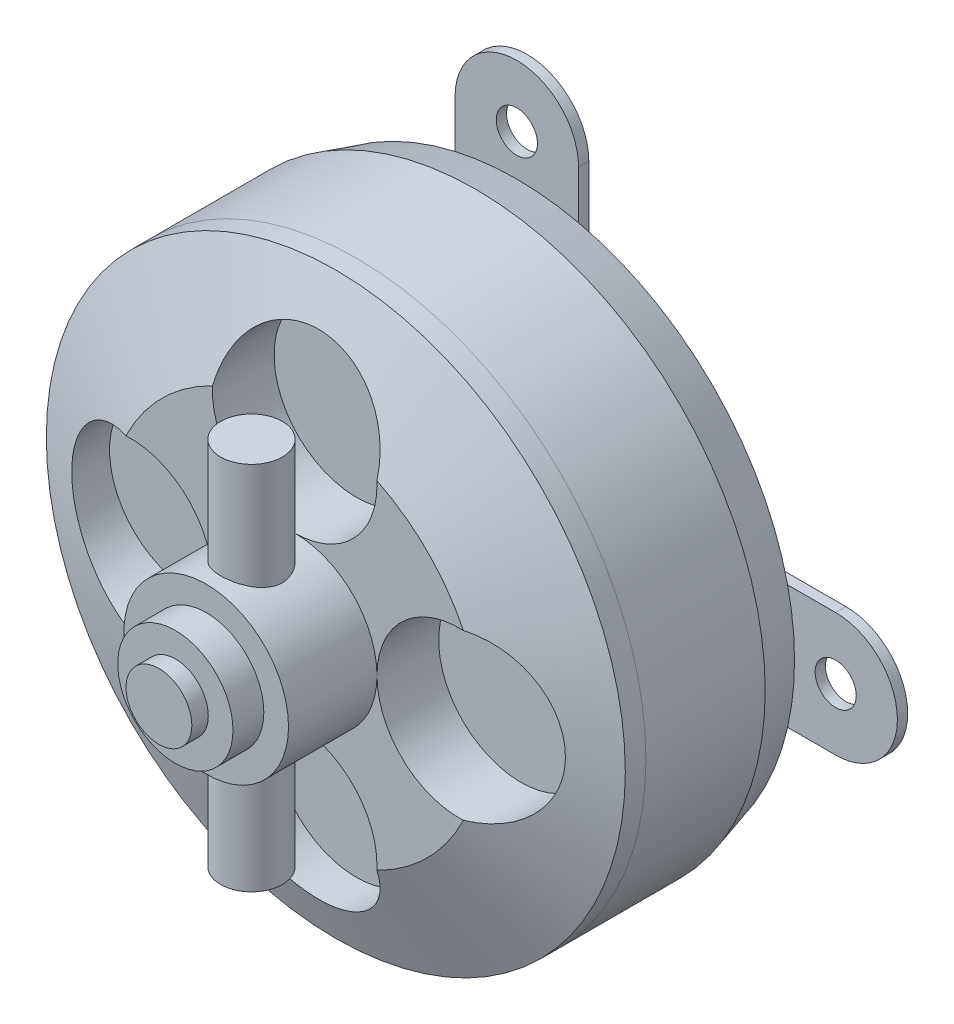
ISO-10303-21;
HEADER;
FILE_DESCRIPTION(('STEP AP214'),'2;1');
FILE_NAME('part.step','',(''),(''),'','','');
FILE_SCHEMA(('AUTOMOTIVE_DESIGN { 1 0 10303 214 1 1 1 1 }'));
ENDSEC;
DATA;
#1=APPLICATION_CONTEXT('core data for automotive mechanical design processes');
#2=APPLICATION_PROTOCOL_DEFINITION('international standard','automotive_design',2000,#1);
#3=PRODUCT_CONTEXT('',#1,'mechanical');
#4=PRODUCT('Part','Part','',(#3));
#5=PRODUCT_RELATED_PRODUCT_CATEGORY('part','',(#4));
#6=PRODUCT_DEFINITION_FORMATION('','',#4);
#7=PRODUCT_DEFINITION_CONTEXT('part definition',#1,'design');
#8=PRODUCT_DEFINITION('design','',#6,#7);
#9=PRODUCT_DEFINITION_SHAPE('','',#8);
#10=(LENGTH_UNIT() NAMED_UNIT(*) SI_UNIT(.MILLI.,.METRE.));
#11=(NAMED_UNIT(*) PLANE_ANGLE_UNIT() SI_UNIT($,.RADIAN.));
#12=(NAMED_UNIT(*) SI_UNIT($,.STERADIAN.) SOLID_ANGLE_UNIT());
#13=UNCERTAINTY_MEASURE_WITH_UNIT(LENGTH_MEASURE(1.E-05),#10,'distance_accuracy_value','');
#14=(GEOMETRIC_REPRESENTATION_CONTEXT(3) GLOBAL_UNCERTAINTY_ASSIGNED_CONTEXT((#13)) GLOBAL_UNIT_ASSIGNED_CONTEXT((#10,
#11,#12)) REPRESENTATION_CONTEXT('',''));
#15=CARTESIAN_POINT('',(0.,0.,0.));
#16=DIRECTION('',(0.,0.,1.));
#17=DIRECTION('',(1.,0.,0.));
#18=AXIS2_PLACEMENT_3D('',#15,#16,#17);
#19=CARTESIAN_POINT('',(0.,0.,17.9));
#20=DIRECTION('',(0.,0.,-1.));
#21=DIRECTION('',(-1.,0.,0.));
#22=AXIS2_PLACEMENT_3D('',#19,#20,#21);
#23=CYLINDRICAL_SURFACE('',#22,1.6);
#24=CARTESIAN_POINT('',(0.,0.,17.9));
#25=DIRECTION('',(0.,0.,1.));
#26=DIRECTION('',(1.,0.,0.));
#27=AXIS2_PLACEMENT_3D('',#24,#25,#26);
#28=CIRCLE('',#27,1.6);
#29=CARTESIAN_POINT('',(1.6,0.,17.9));
#30=VERTEX_POINT('',#29);
#31=EDGE_CURVE('E11',#30,#30,#28,.T.);
#32=ORIENTED_EDGE('',*,*,#31,.F.);
#33=EDGE_LOOP('',(#32));
#34=FACE_BOUND('',#33,.T.);
#35=CARTESIAN_POINT('',(0.,0.,17.1));
#36=DIRECTION('',(0.,0.,1.));
#37=DIRECTION('',(1.,0.,0.));
#38=AXIS2_PLACEMENT_3D('',#35,#36,#37);
#39=CIRCLE('',#38,1.6);
#40=CARTESIAN_POINT('',(1.6,0.,17.1));
#41=VERTEX_POINT('',#40);
#42=EDGE_CURVE('E45',#41,#41,#39,.T.);
#43=ORIENTED_EDGE('',*,*,#42,.T.);
#44=EDGE_LOOP('',(#43));
#45=FACE_BOUND('',#44,.T.);
#46=ADVANCED_FACE('F42',(#34,#45),#23,.T.);
#47=CARTESIAN_POINT('',(0.,0.,17.9));
#48=DIRECTION('',(0.,0.,1.));
#49=DIRECTION('',(1.,0.,0.));
#50=AXIS2_PLACEMENT_3D('',#47,#48,#49);
#51=PLANE('',#50);
#52=ORIENTED_EDGE('',*,*,#31,.T.);
#53=EDGE_LOOP('',(#52));
#54=FACE_BOUND('',#53,.T.);
#55=ADVANCED_FACE('F57',(#54),#51,.T.);
#56=CARTESIAN_POINT('',(0.,0.,17.1));
#57=DIRECTION('',(0.,0.,1.));
#58=DIRECTION('',(1.,0.,0.));
#59=AXIS2_PLACEMENT_3D('',#56,#57,#58);
#60=PLANE('',#59);
#61=ORIENTED_EDGE('',*,*,#42,.F.);
#62=EDGE_LOOP('',(#61));
#63=FACE_BOUND('',#62,.T.);
#64=ADVANCED_FACE('F55',(#63),#60,.F.);
#65=CLOSED_SHELL('',(#46,#55,#64));
#66=MANIFOLD_SOLID_BREP('B2',#65);
#67=CARTESIAN_POINT('',(0.,-9.,13.4));
#68=DIRECTION('',(0.,1.,0.));
#69=DIRECTION('',(0.,0.,1.));
#70=AXIS2_PLACEMENT_3D('',#67,#68,#69);
#71=CYLINDRICAL_SURFACE('',#70,1.5);
#72=CARTESIAN_POINT('',(0.,-9.,13.4));
#73=DIRECTION('',(0.,1.,0.));
#74=DIRECTION('',(0.,0.,1.));
#75=AXIS2_PLACEMENT_3D('',#72,#73,#74);
#76=CIRCLE('',#75,1.5);
#77=CARTESIAN_POINT('',(0.,-9.,14.9));
#78=VERTEX_POINT('',#77);
#79=EDGE_CURVE('E41',#78,#78,#76,.T.);
#80=ORIENTED_EDGE('',*,*,#79,.T.);
#81=EDGE_LOOP('',(#80));
#82=FACE_BOUND('',#81,.T.);
#83=CARTESIAN_POINT('',(0.,9.,13.4));
#84=DIRECTION('',(0.,1.,0.));
#85=DIRECTION('',(0.,0.,1.));
#86=AXIS2_PLACEMENT_3D('',#83,#84,#85);
#87=CIRCLE('',#86,1.5);
#88=CARTESIAN_POINT('',(0.,9.,14.9));
#89=VERTEX_POINT('',#88);
#90=EDGE_CURVE('E98',#89,#89,#87,.T.);
#91=ORIENTED_EDGE('',*,*,#90,.F.);
#92=EDGE_LOOP('',(#91));
#93=FACE_BOUND('',#92,.T.);
#94=ADVANCED_FACE('F92',(#82,#93),#71,.T.);
#95=CARTESIAN_POINT('',(0.,-9.,13.4));
#96=DIRECTION('',(0.,1.,0.));
#97=DIRECTION('',(0.,0.,1.));
#98=AXIS2_PLACEMENT_3D('',#95,#96,#97);
#99=PLANE('',#98);
#100=ORIENTED_EDGE('',*,*,#79,.F.);
#101=EDGE_LOOP('',(#100));
#102=FACE_BOUND('',#101,.T.);
#103=ADVANCED_FACE('F107',(#102),#99,.F.);
#104=CARTESIAN_POINT('',(0.,9.,13.4));
#105=DIRECTION('',(0.,1.,0.));
#106=DIRECTION('',(0.,0.,1.));
#107=AXIS2_PLACEMENT_3D('',#104,#105,#106);
#108=PLANE('',#107);
#109=ORIENTED_EDGE('',*,*,#90,.T.);
#110=EDGE_LOOP('',(#109));
#111=FACE_BOUND('',#110,.T.);
#112=ADVANCED_FACE('F104',(#111),#108,.T.);
#113=CLOSED_SHELL('',(#94,#103,#112));
#114=MANIFOLD_SOLID_BREP('B6',#113);
#115=CARTESIAN_POINT('',(0.,0.,15.6));
#116=DIRECTION('',(0.,0.,1.));
#117=DIRECTION('',(1.,0.,0.));
#118=AXIS2_PLACEMENT_3D('',#115,#116,#117);
#119=PLANE('',#118);
#120=CARTESIAN_POINT('',(0.,0.,15.6));
#121=DIRECTION('',(0.,0.,1.));
#122=DIRECTION('',(1.,0.,0.));
#123=AXIS2_PLACEMENT_3D('',#120,#121,#122);
#124=CIRCLE('',#123,4.);
#125=CARTESIAN_POINT('',(4.,0.,15.6));
#126=VERTEX_POINT('',#125);
#127=EDGE_CURVE('E200',#126,#126,#124,.T.);
#128=ORIENTED_EDGE('',*,*,#127,.T.);
#129=EDGE_LOOP('',(#128));
#130=FACE_BOUND('',#129,.T.);
#131=CARTESIAN_POINT('',(0.,0.,15.6));
#132=DIRECTION('',(0.,0.,1.));
#133=DIRECTION('',(1.,0.,0.));
#134=AXIS2_PLACEMENT_3D('',#131,#132,#133);
#135=CIRCLE('',#134,2.8);
#136=CARTESIAN_POINT('',(2.8,0.,15.6));
#137=VERTEX_POINT('',#136);
#138=EDGE_CURVE('E311',#137,#137,#135,.T.);
#139=ORIENTED_EDGE('',*,*,#138,.F.);
#140=EDGE_LOOP('',(#139));
#141=FACE_BOUND('',#140,.T.);
#142=ADVANCED_FACE('F140',(#130,#141),#119,.T.);
#143=CARTESIAN_POINT('',(0.,0.,11.3));
#144=DIRECTION('',(0.,0.,1.));
#145=DIRECTION('',(1.,0.,0.));
#146=AXIS2_PLACEMENT_3D('',#143,#144,#145);
#147=PLANE('',#146);
#148=CARTESIAN_POINT('',(8.,0.,11.3));
#149=DIRECTION('',(0.,0.,1.));
#150=DIRECTION('',(1.,0.,0.));
#151=AXIS2_PLACEMENT_3D('',#148,#149,#150);
#152=CIRCLE('',#151,4.);
#153=CARTESIAN_POINT('',(4.,0.,11.3));
#154=VERTEX_POINT('',#153);
#155=CARTESIAN_POINT('',(8.20218214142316,-3.99488702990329,11.3));
#156=VERTEX_POINT('',#155);
#157=EDGE_CURVE('E164',#154,#156,#152,.T.);
#158=ORIENTED_EDGE('',*,*,#157,.F.);
#159=CARTESIAN_POINT('',(0.,0.,11.3));
#160=DIRECTION('',(0.,0.,1.));
#161=DIRECTION('',(1.,0.,0.));
#162=AXIS2_PLACEMENT_3D('',#159,#160,#161);
#163=CIRCLE('',#162,4.);
#164=CARTESIAN_POINT('',(0.,-4.,11.3));
#165=VERTEX_POINT('',#164);
#166=EDGE_CURVE('E156',#165,#154,#163,.T.);
#167=ORIENTED_EDGE('',*,*,#166,.F.);
#168=CARTESIAN_POINT('',(0.,-8.,11.3));
#169=DIRECTION('',(0.,0.,1.));
#170=DIRECTION('',(1.,0.,0.));
#171=AXIS2_PLACEMENT_3D('',#168,#169,#170);
#172=CIRCLE('',#171,4.);
#173=CARTESIAN_POINT('',(3.99488702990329,-8.20218214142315,11.3));
#174=VERTEX_POINT('',#173);
#175=EDGE_CURVE('E235',#174,#165,#172,.T.);
#176=ORIENTED_EDGE('',*,*,#175,.F.);
#177=CARTESIAN_POINT('',(0.,0.,11.3));
#178=DIRECTION('',(0.,0.,1.));
#179=DIRECTION('',(1.,0.,0.));
#180=AXIS2_PLACEMENT_3D('',#177,#178,#179);
#181=CIRCLE('',#180,9.12331706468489);
#182=EDGE_CURVE('E247',#174,#156,#181,.T.);
#183=ORIENTED_EDGE('',*,*,#182,.T.);
#184=EDGE_LOOP('',(#158,#167,#176,#183));
#185=FACE_BOUND('',#184,.T.);
#186=ADVANCED_FACE('F284',(#185),#147,.T.);
#187=CARTESIAN_POINT('',(-3.99488702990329,-8.20218214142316,11.3));
#188=VERTEX_POINT('',#187);
#189=EDGE_CURVE('E229',#165,#188,#172,.T.);
#190=ORIENTED_EDGE('',*,*,#189,.F.);
#191=CARTESIAN_POINT('',(-4.,0.,11.3));
#192=VERTEX_POINT('',#191);
#193=EDGE_CURVE('E212',#192,#165,#163,.T.);
#194=ORIENTED_EDGE('',*,*,#193,.F.);
#195=CARTESIAN_POINT('',(-8.,0.,11.3));
#196=DIRECTION('',(0.,0.,1.));
#197=DIRECTION('',(1.,0.,0.));
#198=AXIS2_PLACEMENT_3D('',#195,#196,#197);
#199=CIRCLE('',#198,4.);
#200=CARTESIAN_POINT('',(-8.20218214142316,-3.99488702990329,11.3));
#201=VERTEX_POINT('',#200);
#202=EDGE_CURVE('E230',#201,#192,#199,.T.);
#203=ORIENTED_EDGE('',*,*,#202,.F.);
#204=CARTESIAN_POINT('',(0.,0.,11.3));
#205=DIRECTION('',(0.,0.,1.));
#206=DIRECTION('',(1.,0.,0.));
#207=AXIS2_PLACEMENT_3D('',#204,#205,#206);
#208=CIRCLE('',#207,9.12331706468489);
#209=EDGE_CURVE('E249',#201,#188,#208,.T.);
#210=ORIENTED_EDGE('',*,*,#209,.T.);
#211=EDGE_LOOP('',(#190,#194,#203,#210));
#212=FACE_BOUND('',#211,.T.);
#213=ADVANCED_FACE('F306',(#212),#147,.T.);
#214=CARTESIAN_POINT('',(-8.20218214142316,3.99488702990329,11.3));
#215=VERTEX_POINT('',#214);
#216=EDGE_CURVE('E210',#192,#215,#199,.T.);
#217=ORIENTED_EDGE('',*,*,#216,.F.);
#218=CARTESIAN_POINT('',(0.,4.,11.3));
#219=VERTEX_POINT('',#218);
#220=EDGE_CURVE('E195',#219,#192,#163,.T.);
#221=ORIENTED_EDGE('',*,*,#220,.F.);
#222=CARTESIAN_POINT('',(0.,8.,11.3));
#223=DIRECTION('',(0.,0.,1.));
#224=DIRECTION('',(1.,0.,0.));
#225=AXIS2_PLACEMENT_3D('',#222,#223,#224);
#226=CIRCLE('',#225,4.);
#227=CARTESIAN_POINT('',(-3.99488702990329,8.20218214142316,11.3));
#228=VERTEX_POINT('',#227);
#229=EDGE_CURVE('E208',#228,#219,#226,.T.);
#230=ORIENTED_EDGE('',*,*,#229,.F.);
#231=CARTESIAN_POINT('',(0.,0.,11.3));
#232=DIRECTION('',(0.,0.,1.));
#233=DIRECTION('',(1.,0.,0.));
#234=AXIS2_PLACEMENT_3D('',#231,#232,#233);
#235=CIRCLE('',#234,9.12331706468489);
#236=EDGE_CURVE('E252',#228,#215,#235,.T.);
#237=ORIENTED_EDGE('',*,*,#236,.T.);
#238=EDGE_LOOP('',(#217,#221,#230,#237));
#239=FACE_BOUND('',#238,.T.);
#240=ADVANCED_FACE('F205',(#239),#147,.T.);
#241=CARTESIAN_POINT('',(3.99488702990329,8.20218214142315,11.3));
#242=VERTEX_POINT('',#241);
#243=EDGE_CURVE('E214',#219,#242,#226,.T.);
#244=ORIENTED_EDGE('',*,*,#243,.F.);
#245=EDGE_CURVE('E192',#154,#219,#163,.T.);
#246=ORIENTED_EDGE('',*,*,#245,.F.);
#247=CARTESIAN_POINT('',(8.20218214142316,3.99488702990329,11.3));
#248=VERTEX_POINT('',#247);
#249=EDGE_CURVE('E242',#248,#154,#152,.T.);
#250=ORIENTED_EDGE('',*,*,#249,.F.);
#251=CARTESIAN_POINT('',(0.,0.,11.3));
#252=DIRECTION('',(0.,0.,1.));
#253=DIRECTION('',(1.,0.,0.));
#254=AXIS2_PLACEMENT_3D('',#251,#252,#253);
#255=CIRCLE('',#254,9.12331706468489);
#256=EDGE_CURVE('E217',#248,#242,#255,.T.);
#257=ORIENTED_EDGE('',*,*,#256,.T.);
#258=EDGE_LOOP('',(#244,#246,#250,#257));
#259=FACE_BOUND('',#258,.T.);
#260=ADVANCED_FACE('F215',(#259),#147,.T.);
#261=CARTESIAN_POINT('',(0.,0.,11.3));
#262=DIRECTION('',(0.,0.,-1.));
#263=DIRECTION('',(-1.,0.,0.));
#264=AXIS2_PLACEMENT_3D('',#261,#262,#263);
#265=CYLINDRICAL_SURFACE('',#264,14.0734907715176);
#266=CARTESIAN_POINT('',(0.,0.,9.29999999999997));
#267=DIRECTION('',(0.,0.,1.));
#268=DIRECTION('',(1.,0.,0.));
#269=AXIS2_PLACEMENT_3D('',#266,#267,#268);
#270=CIRCLE('',#269,14.0734907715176);
#271=CARTESIAN_POINT('',(14.0734907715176,0.,9.29999999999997));
#272=VERTEX_POINT('',#271);
#273=EDGE_CURVE('E90',#272,#272,#270,.F.);
#274=ORIENTED_EDGE('',*,*,#273,.T.);
#275=EDGE_LOOP('',(#274));
#276=FACE_BOUND('',#275,.T.);
#277=CARTESIAN_POINT('',(0.,0.,8.3));
#278=DIRECTION('',(0.,0.,1.));
#279=DIRECTION('',(1.,0.,0.));
#280=AXIS2_PLACEMENT_3D('',#277,#278,#279);
#281=CIRCLE('',#280,14.0734907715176);
#282=CARTESIAN_POINT('',(14.0734907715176,0.,8.3));
#283=VERTEX_POINT('',#282);
#284=EDGE_CURVE('E241',#283,#283,#281,.T.);
#285=ORIENTED_EDGE('',*,*,#284,.T.);
#286=EDGE_LOOP('',(#285));
#287=FACE_BOUND('',#286,.T.);
#288=ADVANCED_FACE('F345',(#276,#287),#265,.T.);
#289=CARTESIAN_POINT('',(0.,0.,8.3));
#290=DIRECTION('',(0.,0.,1.));
#291=DIRECTION('',(1.,0.,0.));
#292=AXIS2_PLACEMENT_3D('',#289,#290,#291);
#293=PLANE('',#292);
#294=CARTESIAN_POINT('',(0.,8.,8.3));
#295=DIRECTION('',(0.,0.,1.));
#296=DIRECTION('',(1.,0.,0.));
#297=AXIS2_PLACEMENT_3D('',#294,#295,#296);
#298=CIRCLE('',#297,4.);
#299=CARTESIAN_POINT('',(4.,8.,8.3));
#300=VERTEX_POINT('',#299);
#301=EDGE_CURVE('E222',#300,#300,#298,.T.);
#302=ORIENTED_EDGE('',*,*,#301,.T.);
#303=EDGE_LOOP('',(#302));
#304=FACE_BOUND('',#303,.T.);
#305=CARTESIAN_POINT('',(-8.,0.,8.3));
#306=DIRECTION('',(0.,0.,1.));
#307=DIRECTION('',(1.,0.,0.));
#308=AXIS2_PLACEMENT_3D('',#305,#306,#307);
#309=CIRCLE('',#308,4.);
#310=CARTESIAN_POINT('',(-4.,0.,8.3));
#311=VERTEX_POINT('',#310);
#312=EDGE_CURVE('E226',#311,#311,#309,.T.);
#313=ORIENTED_EDGE('',*,*,#312,.T.);
#314=EDGE_LOOP('',(#313));
#315=FACE_BOUND('',#314,.T.);
#316=CARTESIAN_POINT('',(0.,-8.,8.3));
#317=DIRECTION('',(0.,0.,1.));
#318=DIRECTION('',(1.,0.,0.));
#319=AXIS2_PLACEMENT_3D('',#316,#317,#318);
#320=CIRCLE('',#319,4.);
#321=CARTESIAN_POINT('',(4.,-8.,8.3));
#322=VERTEX_POINT('',#321);
#323=EDGE_CURVE('E232',#322,#322,#320,.T.);
#324=ORIENTED_EDGE('',*,*,#323,.T.);
#325=EDGE_LOOP('',(#324));
#326=FACE_BOUND('',#325,.T.);
#327=CARTESIAN_POINT('',(8.,0.,8.3));
#328=DIRECTION('',(0.,0.,1.));
#329=DIRECTION('',(1.,0.,0.));
#330=AXIS2_PLACEMENT_3D('',#327,#328,#329);
#331=CIRCLE('',#330,4.);
#332=CARTESIAN_POINT('',(12.,0.,8.3));
#333=VERTEX_POINT('',#332);
#334=EDGE_CURVE('E238',#333,#333,#331,.T.);
#335=ORIENTED_EDGE('',*,*,#334,.T.);
#336=EDGE_LOOP('',(#335));
#337=FACE_BOUND('',#336,.T.);
#338=ORIENTED_EDGE('',*,*,#284,.F.);
#339=EDGE_LOOP('',(#338));
#340=FACE_BOUND('',#339,.T.);
#341=ADVANCED_FACE('F282',(#304,#315,#326,#337,#340),#293,.F.);
#342=CARTESIAN_POINT('',(8.,0.,8.3));
#343=DIRECTION('',(0.,0.,1.));
#344=DIRECTION('',(1.,0.,0.));
#345=AXIS2_PLACEMENT_3D('',#342,#343,#344);
#346=CYLINDRICAL_SURFACE('',#345,4.);
#347=ORIENTED_EDGE('',*,*,#334,.F.);
#348=EDGE_LOOP('',(#347));
#349=FACE_BOUND('',#348,.T.);
#350=ORIENTED_EDGE('',*,*,#249,.T.);
#351=ORIENTED_EDGE('',*,*,#157,.T.);
#352=CARTESIAN_POINT('',(8.20218214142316,-3.99488702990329,11.3));
#353=CARTESIAN_POINT('',(8.31630744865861,-3.98912277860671,11.2595652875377));
#354=CARTESIAN_POINT('',(8.43042984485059,-3.97843263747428,11.2198016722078));
#355=CARTESIAN_POINT('',(8.65785138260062,-3.94719944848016,11.1417562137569));
#356=CARTESIAN_POINT('',(8.77115037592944,-3.92665466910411,11.1034746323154));
#357=CARTESIAN_POINT('',(8.99619819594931,-3.87568338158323,11.0285034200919));
#358=CARTESIAN_POINT('',(9.10794505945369,-3.84524537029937,10.9918156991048));
#359=CARTESIAN_POINT('',(9.32888232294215,-3.77458876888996,10.920223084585));
#360=CARTESIAN_POINT('',(9.43807290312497,-3.73437087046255,10.8853180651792));
#361=CARTESIAN_POINT('',(9.65319354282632,-3.64425175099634,10.8173744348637));
#362=CARTESIAN_POINT('',(9.75911855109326,-3.59433632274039,10.7843386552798));
#363=CARTESIAN_POINT('',(9.96670097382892,-3.48508942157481,10.7203096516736));
#364=CARTESIAN_POINT('',(10.0683567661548,-3.42575440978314,10.6893172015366));
#365=CARTESIAN_POINT('',(10.2663689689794,-3.29809514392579,10.6295517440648));
#366=CARTESIAN_POINT('',(10.3627315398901,-3.22978166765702,10.6007761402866));
#367=CARTESIAN_POINT('',(10.5494708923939,-3.08450904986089,10.5455149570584));
#368=CARTESIAN_POINT('',(10.6398455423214,-3.00754685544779,10.5190301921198));
#369=CARTESIAN_POINT('',(10.8106595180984,-2.84839135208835,10.4693751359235));
#370=CARTESIAN_POINT('',(10.891337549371,-2.76648042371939,10.4461206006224));
#371=CARTESIAN_POINT('',(11.045648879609,-2.5956266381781,10.4019483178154));
#372=CARTESIAN_POINT('',(11.1192795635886,-2.50668119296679,10.3810314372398));
#373=CARTESIAN_POINT('',(11.2587811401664,-2.32243276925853,10.3416399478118));
#374=CARTESIAN_POINT('',(11.3246542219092,-2.22713159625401,10.32316464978));
#375=CARTESIAN_POINT('',(11.4480832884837,-2.03080530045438,10.2887240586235));
#376=CARTESIAN_POINT('',(11.5056362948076,-1.92977814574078,10.2727596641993));
#377=CARTESIAN_POINT('',(11.6097242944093,-1.72695063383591,10.2440098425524));
#378=CARTESIAN_POINT('',(11.6566086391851,-1.62534383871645,10.2311225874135));
#379=CARTESIAN_POINT('',(11.741794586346,-1.41827731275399,10.2077843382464));
#380=CARTESIAN_POINT('',(11.7800930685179,-1.31281619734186,10.1973342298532));
#381=CARTESIAN_POINT('',(11.8477215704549,-1.09891426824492,10.1789271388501));
#382=CARTESIAN_POINT('',(11.877056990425,-0.990475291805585,10.1709686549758));
#383=CARTESIAN_POINT('',(11.92653546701,-0.771326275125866,10.1575682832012));
#384=CARTESIAN_POINT('',(11.9466751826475,-0.660615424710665,10.1521273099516));
#385=CARTESIAN_POINT('',(11.9771505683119,-0.44074496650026,10.1439013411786));
#386=CARTESIAN_POINT('',(11.9877320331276,-0.331622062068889,10.1410497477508));
#387=CARTESIAN_POINT('',(11.999912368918,-0.112829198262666,10.1377681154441));
#388=CARTESIAN_POINT('',(12.0015079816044,-0.00315905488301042,10.1373389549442));
#389=CARTESIAN_POINT('',(11.9927415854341,0.3253812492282,10.1396987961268));
#390=CARTESIAN_POINT('',(11.9688614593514,0.544036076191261,10.1461256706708));
#391=CARTESIAN_POINT('',(11.8861685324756,0.972046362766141,10.1684903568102));
#392=CARTESIAN_POINT('',(11.8276562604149,1.18146536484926,10.1843463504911));
#393=CARTESIAN_POINT('',(11.6779215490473,1.58734335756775,10.2252432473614));
#394=CARTESIAN_POINT('',(11.5866960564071,1.78380113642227,10.250285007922));
#395=CARTESIAN_POINT('',(11.3734672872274,2.16032500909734,10.3094513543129));
#396=CARTESIAN_POINT('',(11.251168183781,2.34020952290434,10.3436634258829));
#397=CARTESIAN_POINT('',(10.9802159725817,2.67674687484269,10.4205186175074));
#398=CARTESIAN_POINT('',(10.8315670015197,2.83340335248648,10.4631604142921));
#399=CARTESIAN_POINT('',(10.5083508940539,3.12355129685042,10.55745312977));
#400=CARTESIAN_POINT('',(10.3332127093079,3.25633859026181,10.6093085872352));
#401=CARTESIAN_POINT('',(9.96512093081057,3.49083325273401,10.7205515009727));
#402=CARTESIAN_POINT('',(9.77215226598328,3.59251401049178,10.779945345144));
#403=CARTESIAN_POINT('',(9.46386049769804,3.72442448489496,10.8771091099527));
#404=CARTESIAN_POINT('',(9.35261490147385,3.76622894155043,10.9126018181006));
#405=CARTESIAN_POINT('',(9.12736309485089,3.83967068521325,10.9854665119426));
#406=CARTESIAN_POINT('',(9.01335641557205,3.87130623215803,11.0228388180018));
#407=CARTESIAN_POINT('',(8.78358974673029,3.92426844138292,11.0992855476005));
#408=CARTESIAN_POINT('',(8.66783033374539,3.945598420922,11.1383594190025));
#409=CARTESIAN_POINT('',(8.43544310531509,3.9779606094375,11.2180551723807));
#410=CARTESIAN_POINT('',(8.31881553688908,3.98899564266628,11.2586766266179));
#411=CARTESIAN_POINT('',(8.20218214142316,3.99488702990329,11.3));
#412=B_SPLINE_CURVE_WITH_KNOTS('',3,(#352,#353,#354,#355,#356,#357,#358,#359,#360,#361,#362,
#363,#364,#365,#366,#367,#368,#369,#370,#371,#372,#373,#374,#375,#376,#377,#378,#379,#380,#381,
#382,#383,#384,#385,#386,#387,#388,#389,#390,#391,#392,#393,#394,#395,#396,#397,#398,#399,#400,
#401,#402,#403,#404,#405,#406,#407,#408,#409,#410,#411),.UNSPECIFIED.,.F.,.F.,(4,2,2,2,2,2,2,2,
2,2,2,2,2,2,2,2,2,2,2,2,2,2,2,2,2,2,2,2,2,4),(0.,0.363552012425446,0.727167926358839,
1.09120814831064,1.45522263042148,1.81977448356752,2.18446362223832,2.54871891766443,
2.91310319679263,3.26456258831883,3.6161518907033,3.96764173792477,4.31925710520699,
4.65676857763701,4.99440250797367,5.33183261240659,5.66938521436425,5.99798762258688,
6.32670917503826,6.98339007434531,7.63445433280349,8.28557937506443,8.94315208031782,
9.60062164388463,10.2751010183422,10.9501557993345,11.3218451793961,11.69359812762,
12.0652313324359,12.4367625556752),.UNSPECIFIED.);
#413=EDGE_CURVE('E286',#156,#248,#412,.T.);
#414=ORIENTED_EDGE('',*,*,#413,.T.);
#415=EDGE_LOOP('',(#350,#351,#414));
#416=FACE_BOUND('',#415,.T.);
#417=ADVANCED_FACE('F277',(#349,#416),#346,.F.);
#418=CARTESIAN_POINT('',(0.,-8.,8.3));
#419=DIRECTION('',(0.,0.,1.));
#420=DIRECTION('',(1.,0.,0.));
#421=AXIS2_PLACEMENT_3D('',#418,#419,#420);
#422=CYLINDRICAL_SURFACE('',#421,4.);
#423=ORIENTED_EDGE('',*,*,#323,.F.);
#424=EDGE_LOOP('',(#423));
#425=FACE_BOUND('',#424,.T.);
#426=ORIENTED_EDGE('',*,*,#175,.T.);
#427=ORIENTED_EDGE('',*,*,#189,.T.);
#428=CARTESIAN_POINT('',(-3.99488702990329,-8.20218214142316,11.3));
#429=CARTESIAN_POINT('',(-3.98912277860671,-8.31630744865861,11.2595652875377));
#430=CARTESIAN_POINT('',(-3.97843263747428,-8.43042984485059,11.2198016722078));
#431=CARTESIAN_POINT('',(-3.94719944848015,-8.65785138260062,11.1417562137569));
#432=CARTESIAN_POINT('',(-3.92665466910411,-8.77115037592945,11.1034746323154));
#433=CARTESIAN_POINT('',(-3.87568338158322,-8.99619819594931,11.0285034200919));
#434=CARTESIAN_POINT('',(-3.84524537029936,-9.10794505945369,10.9918156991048));
#435=CARTESIAN_POINT('',(-3.77458876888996,-9.32888232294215,10.920223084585));
#436=CARTESIAN_POINT('',(-3.73437087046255,-9.43807290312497,10.8853180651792));
#437=CARTESIAN_POINT('',(-3.64425175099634,-9.65319354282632,10.8173744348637));
#438=CARTESIAN_POINT('',(-3.59433632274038,-9.75911855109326,10.7843386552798));
#439=CARTESIAN_POINT('',(-3.4850894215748,-9.96670097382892,10.7203096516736));
#440=CARTESIAN_POINT('',(-3.42575440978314,-10.0683567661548,10.6893172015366));
#441=CARTESIAN_POINT('',(-3.29809514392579,-10.2663689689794,10.6295517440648));
#442=CARTESIAN_POINT('',(-3.22978166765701,-10.3627315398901,10.6007761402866));
#443=CARTESIAN_POINT('',(-3.08450904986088,-10.5494708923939,10.5455149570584));
#444=CARTESIAN_POINT('',(-3.00754685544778,-10.6398455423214,10.5190301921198));
#445=CARTESIAN_POINT('',(-2.84839135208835,-10.8106595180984,10.4693751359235));
#446=CARTESIAN_POINT('',(-2.76648042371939,-10.891337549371,10.4461206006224));
#447=CARTESIAN_POINT('',(-2.5956266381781,-11.045648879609,10.4019483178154));
#448=CARTESIAN_POINT('',(-2.50668119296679,-11.1192795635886,10.3810314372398));
#449=CARTESIAN_POINT('',(-2.32243276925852,-11.2587811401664,10.3416399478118));
#450=CARTESIAN_POINT('',(-2.22713159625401,-11.3246542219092,10.32316464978));
#451=CARTESIAN_POINT('',(-2.03080530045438,-11.4480832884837,10.2887240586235));
#452=CARTESIAN_POINT('',(-1.92977814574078,-11.5056362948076,10.2727596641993));
#453=CARTESIAN_POINT('',(-1.72695063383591,-11.6097242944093,10.2440098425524));
#454=CARTESIAN_POINT('',(-1.62534383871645,-11.6566086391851,10.2311225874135));
#455=CARTESIAN_POINT('',(-1.41827731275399,-11.741794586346,10.2077843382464));
#456=CARTESIAN_POINT('',(-1.31281619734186,-11.7800930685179,10.1973342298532));
#457=CARTESIAN_POINT('',(-1.09891426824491,-11.8477215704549,10.1789271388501));
#458=CARTESIAN_POINT('',(-0.990475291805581,-11.877056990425,10.1709686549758));
#459=CARTESIAN_POINT('',(-0.771326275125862,-11.92653546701,10.1575682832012));
#460=CARTESIAN_POINT('',(-0.660615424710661,-11.9466751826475,10.1521273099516));
#461=CARTESIAN_POINT('',(-0.440744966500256,-11.9771505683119,10.1439013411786));
#462=CARTESIAN_POINT('',(-0.331622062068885,-11.9877320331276,10.1410497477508));
#463=CARTESIAN_POINT('',(-0.112829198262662,-11.999912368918,10.1377681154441));
#464=CARTESIAN_POINT('',(-0.00315905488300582,-12.0015079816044,10.1373389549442));
#465=CARTESIAN_POINT('',(0.325381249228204,-11.9927415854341,10.1396987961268));
#466=CARTESIAN_POINT('',(0.544036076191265,-11.9688614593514,10.1461256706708));
#467=CARTESIAN_POINT('',(0.972046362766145,-11.8861685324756,10.1684903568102));
#468=CARTESIAN_POINT('',(1.18146536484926,-11.8276562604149,10.1843463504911));
#469=CARTESIAN_POINT('',(1.58734335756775,-11.6779215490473,10.2252432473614));
#470=CARTESIAN_POINT('',(1.78380113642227,-11.5866960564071,10.250285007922));
#471=CARTESIAN_POINT('',(2.16032500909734,-11.3734672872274,10.3094513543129));
#472=CARTESIAN_POINT('',(2.34020952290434,-11.251168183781,10.3436634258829));
#473=CARTESIAN_POINT('',(2.67674687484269,-10.9802159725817,10.4205186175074));
#474=CARTESIAN_POINT('',(2.83340335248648,-10.8315670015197,10.4631604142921));
#475=CARTESIAN_POINT('',(3.12355129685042,-10.5083508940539,10.55745312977));
#476=CARTESIAN_POINT('',(3.25633859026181,-10.3332127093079,10.6093085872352));
#477=CARTESIAN_POINT('',(3.49083325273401,-9.96512093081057,10.7205515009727));
#478=CARTESIAN_POINT('',(3.59251401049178,-9.77215226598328,10.779945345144));
#479=CARTESIAN_POINT('',(3.72442448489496,-9.46386049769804,10.8771091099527));
#480=CARTESIAN_POINT('',(3.76622894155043,-9.35261490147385,10.9126018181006));
#481=CARTESIAN_POINT('',(3.83967068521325,-9.12736309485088,10.9854665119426));
#482=CARTESIAN_POINT('',(3.87130623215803,-9.01335641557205,11.0228388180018));
#483=CARTESIAN_POINT('',(3.92426844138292,-8.78358974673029,11.0992855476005));
#484=CARTESIAN_POINT('',(3.945598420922,-8.66783033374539,11.1383594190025));
#485=CARTESIAN_POINT('',(3.9779606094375,-8.43544310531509,11.2180551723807));
#486=CARTESIAN_POINT('',(3.98899564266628,-8.31881553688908,11.2586766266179));
#487=CARTESIAN_POINT('',(3.99488702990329,-8.20218214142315,11.3));
#488=B_SPLINE_CURVE_WITH_KNOTS('',3,(#428,#429,#430,#431,#432,#433,#434,#435,#436,#437,#438,
#439,#440,#441,#442,#443,#444,#445,#446,#447,#448,#449,#450,#451,#452,#453,#454,#455,#456,#457,
#458,#459,#460,#461,#462,#463,#464,#465,#466,#467,#468,#469,#470,#471,#472,#473,#474,#475,#476,
#477,#478,#479,#480,#481,#482,#483,#484,#485,#486,#487),.UNSPECIFIED.,.F.,.F.,(4,2,2,2,2,2,2,2,
2,2,2,2,2,2,2,2,2,2,2,2,2,2,2,2,2,2,2,2,2,4),(0.,0.363552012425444,0.727167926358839,
1.09120814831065,1.45522263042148,1.81977448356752,2.18446362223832,2.54871891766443,
2.91310319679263,3.26456258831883,3.6161518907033,3.96764173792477,4.31925710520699,
4.65676857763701,4.99440250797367,5.33183261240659,5.66938521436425,5.99798762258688,
6.32670917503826,6.9833900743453,7.63445433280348,8.28557937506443,8.94315208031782,
9.60062164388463,10.2751010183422,10.9501557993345,11.3218451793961,11.69359812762,
12.0652313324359,12.4367625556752),.UNSPECIFIED.);
#489=EDGE_CURVE('E260',#188,#174,#488,.T.);
#490=ORIENTED_EDGE('',*,*,#489,.T.);
#491=EDGE_LOOP('',(#426,#427,#490));
#492=FACE_BOUND('',#491,.T.);
#493=ADVANCED_FACE('F270',(#425,#492),#422,.F.);
#494=CARTESIAN_POINT('',(-8.,0.,8.3));
#495=DIRECTION('',(0.,0.,1.));
#496=DIRECTION('',(1.,0.,0.));
#497=AXIS2_PLACEMENT_3D('',#494,#495,#496);
#498=CYLINDRICAL_SURFACE('',#497,4.);
#499=ORIENTED_EDGE('',*,*,#312,.F.);
#500=EDGE_LOOP('',(#499));
#501=FACE_BOUND('',#500,.T.);
#502=ORIENTED_EDGE('',*,*,#202,.T.);
#503=ORIENTED_EDGE('',*,*,#216,.T.);
#504=CARTESIAN_POINT('',(-8.20218214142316,3.99488702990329,11.3));
#505=CARTESIAN_POINT('',(-8.31630744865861,3.98912277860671,11.2595652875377));
#506=CARTESIAN_POINT('',(-8.43042984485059,3.97843263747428,11.2198016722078));
#507=CARTESIAN_POINT('',(-8.65785138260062,3.94719944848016,11.1417562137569));
#508=CARTESIAN_POINT('',(-8.77115037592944,3.92665466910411,11.1034746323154));
#509=CARTESIAN_POINT('',(-8.99619819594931,3.87568338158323,11.0285034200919));
#510=CARTESIAN_POINT('',(-9.10794505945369,3.84524537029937,10.9918156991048));
#511=CARTESIAN_POINT('',(-9.32888232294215,3.77458876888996,10.920223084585));
#512=CARTESIAN_POINT('',(-9.43807290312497,3.73437087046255,10.8853180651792));
#513=CARTESIAN_POINT('',(-9.65319354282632,3.64425175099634,10.8173744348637));
#514=CARTESIAN_POINT('',(-9.75911855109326,3.59433632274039,10.7843386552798));
#515=CARTESIAN_POINT('',(-9.96670097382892,3.48508942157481,10.7203096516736));
#516=CARTESIAN_POINT('',(-10.0683567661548,3.42575440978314,10.6893172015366));
#517=CARTESIAN_POINT('',(-10.2663689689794,3.29809514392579,10.6295517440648));
#518=CARTESIAN_POINT('',(-10.3627315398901,3.22978166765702,10.6007761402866));
#519=CARTESIAN_POINT('',(-10.5494708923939,3.08450904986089,10.5455149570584));
#520=CARTESIAN_POINT('',(-10.6398455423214,3.00754685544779,10.5190301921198));
#521=CARTESIAN_POINT('',(-10.8106595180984,2.84839135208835,10.4693751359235));
#522=CARTESIAN_POINT('',(-10.891337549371,2.76648042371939,10.4461206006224));
#523=CARTESIAN_POINT('',(-11.045648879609,2.5956266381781,10.4019483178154));
#524=CARTESIAN_POINT('',(-11.1192795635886,2.50668119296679,10.3810314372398));
#525=CARTESIAN_POINT('',(-11.2587811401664,2.32243276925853,10.3416399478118));
#526=CARTESIAN_POINT('',(-11.3246542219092,2.22713159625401,10.32316464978));
#527=CARTESIAN_POINT('',(-11.4480832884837,2.03080530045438,10.2887240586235));
#528=CARTESIAN_POINT('',(-11.5056362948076,1.92977814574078,10.2727596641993));
#529=CARTESIAN_POINT('',(-11.6097242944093,1.72695063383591,10.2440098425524));
#530=CARTESIAN_POINT('',(-11.6566086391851,1.62534383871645,10.2311225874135));
#531=CARTESIAN_POINT('',(-11.741794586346,1.41827731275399,10.2077843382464));
#532=CARTESIAN_POINT('',(-11.7800930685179,1.31281619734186,10.1973342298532));
#533=CARTESIAN_POINT('',(-11.8477215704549,1.09891426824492,10.1789271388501));
#534=CARTESIAN_POINT('',(-11.877056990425,0.990475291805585,10.1709686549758));
#535=CARTESIAN_POINT('',(-11.92653546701,0.771326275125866,10.1575682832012));
#536=CARTESIAN_POINT('',(-11.9466751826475,0.660615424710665,10.1521273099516));
#537=CARTESIAN_POINT('',(-11.9771505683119,0.44074496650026,10.1439013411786));
#538=CARTESIAN_POINT('',(-11.9877320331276,0.331622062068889,10.1410497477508));
#539=CARTESIAN_POINT('',(-11.999912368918,0.112829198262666,10.1377681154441));
#540=CARTESIAN_POINT('',(-12.0015079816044,0.00315905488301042,10.1373389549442));
#541=CARTESIAN_POINT('',(-11.9927415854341,-0.3253812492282,10.1396987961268));
#542=CARTESIAN_POINT('',(-11.9688614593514,-0.544036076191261,10.1461256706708));
#543=CARTESIAN_POINT('',(-11.8861685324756,-0.972046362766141,10.1684903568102));
#544=CARTESIAN_POINT('',(-11.8276562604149,-1.18146536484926,10.1843463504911));
#545=CARTESIAN_POINT('',(-11.6779215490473,-1.58734335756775,10.2252432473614));
#546=CARTESIAN_POINT('',(-11.5866960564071,-1.78380113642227,10.250285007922));
#547=CARTESIAN_POINT('',(-11.3734672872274,-2.16032500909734,10.3094513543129));
#548=CARTESIAN_POINT('',(-11.251168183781,-2.34020952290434,10.3436634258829));
#549=CARTESIAN_POINT('',(-10.9802159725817,-2.67674687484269,10.4205186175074));
#550=CARTESIAN_POINT('',(-10.8315670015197,-2.83340335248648,10.4631604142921));
#551=CARTESIAN_POINT('',(-10.5083508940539,-3.12355129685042,10.55745312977));
#552=CARTESIAN_POINT('',(-10.3332127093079,-3.25633859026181,10.6093085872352));
#553=CARTESIAN_POINT('',(-9.96512093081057,-3.49083325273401,10.7205515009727));
#554=CARTESIAN_POINT('',(-9.77215226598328,-3.59251401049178,10.779945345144));
#555=CARTESIAN_POINT('',(-9.46386049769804,-3.72442448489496,10.8771091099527));
#556=CARTESIAN_POINT('',(-9.35261490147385,-3.76622894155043,10.9126018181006));
#557=CARTESIAN_POINT('',(-9.12736309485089,-3.83967068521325,10.9854665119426));
#558=CARTESIAN_POINT('',(-9.01335641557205,-3.87130623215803,11.0228388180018));
#559=CARTESIAN_POINT('',(-8.78358974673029,-3.92426844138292,11.0992855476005));
#560=CARTESIAN_POINT('',(-8.66783033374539,-3.945598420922,11.1383594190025));
#561=CARTESIAN_POINT('',(-8.43544310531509,-3.9779606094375,11.2180551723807));
#562=CARTESIAN_POINT('',(-8.31881553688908,-3.98899564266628,11.2586766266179));
#563=CARTESIAN_POINT('',(-8.20218214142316,-3.99488702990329,11.3));
#564=B_SPLINE_CURVE_WITH_KNOTS('',3,(#504,#505,#506,#507,#508,#509,#510,#511,#512,#513,#514,
#515,#516,#517,#518,#519,#520,#521,#522,#523,#524,#525,#526,#527,#528,#529,#530,#531,#532,#533,
#534,#535,#536,#537,#538,#539,#540,#541,#542,#543,#544,#545,#546,#547,#548,#549,#550,#551,#552,
#553,#554,#555,#556,#557,#558,#559,#560,#561,#562,#563),.UNSPECIFIED.,.F.,.F.,(4,2,2,2,2,2,2,2,
2,2,2,2,2,2,2,2,2,2,2,2,2,2,2,2,2,2,2,2,2,4),(0.,0.363552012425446,0.727167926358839,
1.09120814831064,1.45522263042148,1.81977448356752,2.18446362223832,2.54871891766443,
2.91310319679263,3.26456258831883,3.6161518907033,3.96764173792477,4.31925710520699,
4.65676857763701,4.99440250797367,5.33183261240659,5.66938521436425,5.99798762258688,
6.32670917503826,6.98339007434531,7.63445433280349,8.28557937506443,8.94315208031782,
9.60062164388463,10.2751010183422,10.9501557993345,11.3218451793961,11.69359812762,
12.0652313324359,12.4367625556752),.UNSPECIFIED.);
#565=EDGE_CURVE('E254',#215,#201,#564,.T.);
#566=ORIENTED_EDGE('',*,*,#565,.T.);
#567=EDGE_LOOP('',(#502,#503,#566));
#568=FACE_BOUND('',#567,.T.);
#569=ADVANCED_FACE('F266',(#501,#568),#498,.F.);
#570=CARTESIAN_POINT('',(0.,8.,8.3));
#571=DIRECTION('',(0.,0.,1.));
#572=DIRECTION('',(1.,0.,0.));
#573=AXIS2_PLACEMENT_3D('',#570,#571,#572);
#574=CYLINDRICAL_SURFACE('',#573,4.);
#575=ORIENTED_EDGE('',*,*,#301,.F.);
#576=EDGE_LOOP('',(#575));
#577=FACE_BOUND('',#576,.T.);
#578=ORIENTED_EDGE('',*,*,#229,.T.);
#579=ORIENTED_EDGE('',*,*,#243,.T.);
#580=CARTESIAN_POINT('',(3.99488702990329,8.20218214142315,11.3));
#581=CARTESIAN_POINT('',(3.98912277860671,8.31630744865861,11.2595652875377));
#582=CARTESIAN_POINT('',(3.97843263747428,8.43042984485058,11.2198016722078));
#583=CARTESIAN_POINT('',(3.94719944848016,8.65785138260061,11.1417562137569));
#584=CARTESIAN_POINT('',(3.92665466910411,8.77115037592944,11.1034746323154));
#585=CARTESIAN_POINT('',(3.87568338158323,8.99619819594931,11.0285034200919));
#586=CARTESIAN_POINT('',(3.84524537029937,9.10794505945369,10.9918156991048));
#587=CARTESIAN_POINT('',(3.77458876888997,9.32888232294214,10.920223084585));
#588=CARTESIAN_POINT('',(3.73437087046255,9.43807290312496,10.8853180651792));
#589=CARTESIAN_POINT('',(3.64425175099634,9.65319354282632,10.8173744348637));
#590=CARTESIAN_POINT('',(3.59433632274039,9.75911855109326,10.7843386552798));
#591=CARTESIAN_POINT('',(3.48508942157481,9.96670097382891,10.7203096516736));
#592=CARTESIAN_POINT('',(3.42575440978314,10.0683567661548,10.6893172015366));
#593=CARTESIAN_POINT('',(3.2980951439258,10.2663689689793,10.6295517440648));
#594=CARTESIAN_POINT('',(3.22978166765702,10.3627315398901,10.6007761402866));
#595=CARTESIAN_POINT('',(3.08450904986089,10.5494708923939,10.5455149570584));
#596=CARTESIAN_POINT('',(3.00754685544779,10.6398455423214,10.5190301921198));
#597=CARTESIAN_POINT('',(2.84839135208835,10.8106595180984,10.4693751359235));
#598=CARTESIAN_POINT('',(2.7664804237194,10.891337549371,10.4461206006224));
#599=CARTESIAN_POINT('',(2.5956266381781,11.045648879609,10.4019483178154));
#600=CARTESIAN_POINT('',(2.50668119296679,11.1192795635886,10.3810314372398));
#601=CARTESIAN_POINT('',(2.32243276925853,11.2587811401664,10.3416399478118));
#602=CARTESIAN_POINT('',(2.22713159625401,11.3246542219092,10.32316464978));
#603=CARTESIAN_POINT('',(2.03080530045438,11.4480832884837,10.2887240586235));
#604=CARTESIAN_POINT('',(1.92977814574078,11.5056362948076,10.2727596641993));
#605=CARTESIAN_POINT('',(1.72695063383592,11.6097242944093,10.2440098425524));
#606=CARTESIAN_POINT('',(1.62534383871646,11.6566086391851,10.2311225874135));
#607=CARTESIAN_POINT('',(1.41827731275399,11.741794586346,10.2077843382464));
#608=CARTESIAN_POINT('',(1.31281619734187,11.7800930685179,10.1973342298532));
#609=CARTESIAN_POINT('',(1.09891426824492,11.8477215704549,10.1789271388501));
#610=CARTESIAN_POINT('',(0.990475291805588,11.877056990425,10.1709686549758));
#611=CARTESIAN_POINT('',(0.771326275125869,11.92653546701,10.1575682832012));
#612=CARTESIAN_POINT('',(0.660615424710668,11.9466751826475,10.1521273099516));
#613=CARTESIAN_POINT('',(0.440744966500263,11.9771505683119,10.1439013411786));
#614=CARTESIAN_POINT('',(0.331622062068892,11.9877320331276,10.1410497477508));
#615=CARTESIAN_POINT('',(0.112829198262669,11.999912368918,10.1377681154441));
#616=CARTESIAN_POINT('',(0.00315905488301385,12.0015079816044,10.1373389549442));
#617=CARTESIAN_POINT('',(-0.325381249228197,11.9927415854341,10.1396987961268));
#618=CARTESIAN_POINT('',(-0.544036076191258,11.9688614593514,10.1461256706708));
#619=CARTESIAN_POINT('',(-0.972046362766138,11.8861685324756,10.1684903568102));
#620=CARTESIAN_POINT('',(-1.18146536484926,11.8276562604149,10.1843463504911));
#621=CARTESIAN_POINT('',(-1.58734335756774,11.6779215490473,10.2252432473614));
#622=CARTESIAN_POINT('',(-1.78380113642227,11.5866960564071,10.250285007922));
#623=CARTESIAN_POINT('',(-2.16032500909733,11.3734672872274,10.3094513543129));
#624=CARTESIAN_POINT('',(-2.34020952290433,11.251168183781,10.3436634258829));
#625=CARTESIAN_POINT('',(-2.67674687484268,10.9802159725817,10.4205186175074));
#626=CARTESIAN_POINT('',(-2.83340335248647,10.8315670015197,10.4631604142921));
#627=CARTESIAN_POINT('',(-3.12355129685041,10.5083508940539,10.55745312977));
#628=CARTESIAN_POINT('',(-3.2563385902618,10.3332127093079,10.6093085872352));
#629=CARTESIAN_POINT('',(-3.49083325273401,9.96512093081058,10.7205515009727));
#630=CARTESIAN_POINT('',(-3.59251401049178,9.77215226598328,10.779945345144));
#631=CARTESIAN_POINT('',(-3.72442448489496,9.46386049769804,10.8771091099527));
#632=CARTESIAN_POINT('',(-3.76622894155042,9.35261490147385,10.9126018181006));
#633=CARTESIAN_POINT('',(-3.83967068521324,9.12736309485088,10.9854665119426));
#634=CARTESIAN_POINT('',(-3.87130623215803,9.01335641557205,11.0228388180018));
#635=CARTESIAN_POINT('',(-3.92426844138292,8.78358974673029,11.0992855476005));
#636=CARTESIAN_POINT('',(-3.94559842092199,8.66783033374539,11.1383594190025));
#637=CARTESIAN_POINT('',(-3.97796060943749,8.43544310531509,11.2180551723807));
#638=CARTESIAN_POINT('',(-3.98899564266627,8.31881553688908,11.2586766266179));
#639=CARTESIAN_POINT('',(-3.99488702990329,8.20218214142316,11.3));
#640=B_SPLINE_CURVE_WITH_KNOTS('',3,(#580,#581,#582,#583,#584,#585,#586,#587,#588,#589,#590,
#591,#592,#593,#594,#595,#596,#597,#598,#599,#600,#601,#602,#603,#604,#605,#606,#607,#608,#609,
#610,#611,#612,#613,#614,#615,#616,#617,#618,#619,#620,#621,#622,#623,#624,#625,#626,#627,#628,
#629,#630,#631,#632,#633,#634,#635,#636,#637,#638,#639),.UNSPECIFIED.,.F.,.F.,(4,2,2,2,2,2,2,2,
2,2,2,2,2,2,2,2,2,2,2,2,2,2,2,2,2,2,2,2,2,4),(0.,0.363552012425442,0.727167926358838,
1.09120814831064,1.45522263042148,1.81977448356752,2.18446362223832,2.54871891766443,
2.91310319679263,3.26456258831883,3.6161518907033,3.96764173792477,4.31925710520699,
4.65676857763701,4.99440250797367,5.33183261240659,5.66938521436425,5.99798762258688,
6.32670917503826,6.9833900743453,7.63445433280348,8.28557937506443,8.94315208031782,
9.60062164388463,10.2751010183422,10.9501557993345,11.3218451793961,11.69359812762,
12.0652313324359,12.4367625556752),.UNSPECIFIED.);
#641=EDGE_CURVE('E149',#242,#228,#640,.T.);
#642=ORIENTED_EDGE('',*,*,#641,.T.);
#643=EDGE_LOOP('',(#578,#579,#642));
#644=FACE_BOUND('',#643,.T.);
#645=ADVANCED_FACE('F221',(#577,#644),#574,.F.);
#646=CARTESIAN_POINT('',(0.,0.,11.3));
#647=DIRECTION('',(0.,0.,-1.));
#648=DIRECTION('',(-1.,0.,0.));
#649=AXIS2_PLACEMENT_3D('',#646,#647,#648);
#650=CONICAL_SURFACE('',#649,9.12331706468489,1.18682389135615);
#651=ORIENTED_EDGE('',*,*,#273,.F.);
#652=EDGE_LOOP('',(#651));
#653=FACE_BOUND('',#652,.T.);
#654=ORIENTED_EDGE('',*,*,#565,.F.);
#655=ORIENTED_EDGE('',*,*,#236,.F.);
#656=ORIENTED_EDGE('',*,*,#641,.F.);
#657=ORIENTED_EDGE('',*,*,#256,.F.);
#658=ORIENTED_EDGE('',*,*,#413,.F.);
#659=ORIENTED_EDGE('',*,*,#182,.F.);
#660=ORIENTED_EDGE('',*,*,#489,.F.);
#661=ORIENTED_EDGE('',*,*,#209,.F.);
#662=EDGE_LOOP('',(#654,#655,#656,#657,#658,#659,#660,#661));
#663=FACE_BOUND('',#662,.T.);
#664=ADVANCED_FACE('F142',(#653,#663),#650,.T.);
#665=CARTESIAN_POINT('',(0.,0.,15.6));
#666=DIRECTION('',(0.,0.,-1.));
#667=DIRECTION('',(-1.,0.,0.));
#668=AXIS2_PLACEMENT_3D('',#665,#666,#667);
#669=CYLINDRICAL_SURFACE('',#668,4.);
#670=ORIENTED_EDGE('',*,*,#127,.F.);
#671=EDGE_LOOP('',(#670));
#672=FACE_BOUND('',#671,.T.);
#673=ORIENTED_EDGE('',*,*,#245,.T.);
#674=ORIENTED_EDGE('',*,*,#220,.T.);
#675=ORIENTED_EDGE('',*,*,#193,.T.);
#676=ORIENTED_EDGE('',*,*,#166,.T.);
#677=EDGE_LOOP('',(#673,#674,#675,#676));
#678=FACE_BOUND('',#677,.T.);
#679=ADVANCED_FACE('F194',(#672,#678),#669,.T.);
#680=CARTESIAN_POINT('',(0.,0.,17.1));
#681=DIRECTION('',(0.,0.,-1.));
#682=DIRECTION('',(-1.,0.,0.));
#683=AXIS2_PLACEMENT_3D('',#680,#681,#682);
#684=CYLINDRICAL_SURFACE('',#683,2.8);
#685=CARTESIAN_POINT('',(0.,0.,17.1));
#686=DIRECTION('',(0.,0.,1.));
#687=DIRECTION('',(1.,0.,0.));
#688=AXIS2_PLACEMENT_3D('',#685,#686,#687);
#689=CIRCLE('',#688,2.8);
#690=CARTESIAN_POINT('',(2.8,0.,17.1));
#691=VERTEX_POINT('',#690);
#692=EDGE_CURVE('E307',#691,#691,#689,.T.);
#693=ORIENTED_EDGE('',*,*,#692,.F.);
#694=EDGE_LOOP('',(#693));
#695=FACE_BOUND('',#694,.T.);
#696=ORIENTED_EDGE('',*,*,#138,.T.);
#697=EDGE_LOOP('',(#696));
#698=FACE_BOUND('',#697,.T.);
#699=ADVANCED_FACE('F319',(#695,#698),#684,.T.);
#700=CARTESIAN_POINT('',(0.,0.,17.1));
#701=DIRECTION('',(0.,0.,1.));
#702=DIRECTION('',(1.,0.,0.));
#703=AXIS2_PLACEMENT_3D('',#700,#701,#702);
#704=PLANE('',#703);
#705=ORIENTED_EDGE('',*,*,#692,.T.);
#706=EDGE_LOOP('',(#705));
#707=FACE_BOUND('',#706,.T.);
#708=ADVANCED_FACE('F317',(#707),#704,.T.);
#709=CLOSED_SHELL('',(#142,#186,#213,#240,#260,#288,#341,#417,#493,#569,#645,#664,#679,#699,#708));
#710=MANIFOLD_SOLID_BREP('B36',#709);
#711=CARTESIAN_POINT('',(0.,0.,8.3));
#712=DIRECTION('',(0.,0.,-1.));
#713=DIRECTION('',(-1.,0.,0.));
#714=AXIS2_PLACEMENT_3D('',#711,#712,#713);
#715=CYLINDRICAL_SURFACE('',#714,14.0734907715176);
#716=CARTESIAN_POINT('',(0.,0.,8.3));
#717=DIRECTION('',(0.,0.,1.));
#718=DIRECTION('',(1.,0.,0.));
#719=AXIS2_PLACEMENT_3D('',#716,#717,#718);
#720=CIRCLE('',#719,14.0734907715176);
#721=CARTESIAN_POINT('',(14.0734907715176,0.,8.3));
#722=VERTEX_POINT('',#721);
#723=EDGE_CURVE('E139',#722,#722,#720,.T.);
#724=ORIENTED_EDGE('',*,*,#723,.F.);
#725=EDGE_LOOP('',(#724));
#726=FACE_BOUND('',#725,.T.);
#727=CARTESIAN_POINT('',(0.,0.,2.5));
#728=DIRECTION('',(0.,0.,1.));
#729=DIRECTION('',(1.,0.,0.));
#730=AXIS2_PLACEMENT_3D('',#727,#728,#729);
#731=CIRCLE('',#730,14.0734907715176);
#732=CARTESIAN_POINT('',(14.0734907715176,0.,2.5));
#733=VERTEX_POINT('',#732);
#734=EDGE_CURVE('E464',#733,#733,#731,.T.);
#735=ORIENTED_EDGE('',*,*,#734,.T.);
#736=EDGE_LOOP('',(#735));
#737=FACE_BOUND('',#736,.T.);
#738=ADVANCED_FACE('F461',(#726,#737),#715,.T.);
#739=CARTESIAN_POINT('',(0.,0.,8.3));
#740=DIRECTION('',(0.,0.,1.));
#741=DIRECTION('',(1.,0.,0.));
#742=AXIS2_PLACEMENT_3D('',#739,#740,#741);
#743=PLANE('',#742);
#744=ORIENTED_EDGE('',*,*,#723,.T.);
#745=EDGE_LOOP('',(#744));
#746=FACE_BOUND('',#745,.T.);
#747=ADVANCED_FACE('F476',(#746),#743,.T.);
#748=CARTESIAN_POINT('',(0.,0.,2.5));
#749=DIRECTION('',(0.,0.,1.));
#750=DIRECTION('',(1.,0.,0.));
#751=AXIS2_PLACEMENT_3D('',#748,#749,#750);
#752=PLANE('',#751);
#753=ORIENTED_EDGE('',*,*,#734,.F.);
#754=EDGE_LOOP('',(#753));
#755=FACE_BOUND('',#754,.T.);
#756=ADVANCED_FACE('F474',(#755),#752,.F.);
#757=CLOSED_SHELL('',(#738,#747,#756));
#758=MANIFOLD_SOLID_BREP('B84',#757);
#759=CARTESIAN_POINT('',(0.,15.5,0.5));
#760=DIRECTION('',(0.,0.,1.));
#761=DIRECTION('',(1.,0.,0.));
#762=AXIS2_PLACEMENT_3D('',#759,#760,#761);
#763=PLANE('',#762);
#764=CARTESIAN_POINT('',(0.,0.,0.5));
#765=DIRECTION('',(0.,0.,1.));
#766=DIRECTION('',(1.,0.,0.));
#767=AXIS2_PLACEMENT_3D('',#764,#765,#766);
#768=CIRCLE('',#767,13.5);
#769=CARTESIAN_POINT('',(3.,13.1624465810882,0.5));
#770=VERTEX_POINT('',#769);
#771=CARTESIAN_POINT('',(-3.,13.1624465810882,0.5));
#772=VERTEX_POINT('',#771);
#773=EDGE_CURVE('E459',#770,#772,#768,.T.);
#774=ORIENTED_EDGE('',*,*,#773,.F.);
#775=DIRECTION('',(0.,1.,0.));
#776=VECTOR('',#775,1.);
#777=CARTESIAN_POINT('',(3.,15.5,0.5));
#778=LINE('',#777,#776);
#779=CARTESIAN_POINT('',(3.,15.5,0.5));
#780=VERTEX_POINT('',#779);
#781=EDGE_CURVE('E623',#770,#780,#778,.T.);
#782=ORIENTED_EDGE('',*,*,#781,.T.);
#783=CARTESIAN_POINT('',(0.,15.5,0.5));
#784=DIRECTION('',(0.,0.,1.));
#785=DIRECTION('',(1.,0.,0.));
#786=AXIS2_PLACEMENT_3D('',#783,#784,#785);
#787=CIRCLE('',#786,3.);
#788=CARTESIAN_POINT('',(-3.,15.5,0.5));
#789=VERTEX_POINT('',#788);
#790=EDGE_CURVE('E709',#780,#789,#787,.T.);
#791=ORIENTED_EDGE('',*,*,#790,.T.);
#792=DIRECTION('',(0.,-1.,0.));
#793=VECTOR('',#792,1.);
#794=CARTESIAN_POINT('',(-2.99999999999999,3.,0.5));
#795=LINE('',#794,#793);
#796=EDGE_CURVE('E743',#789,#772,#795,.T.);
#797=ORIENTED_EDGE('',*,*,#796,.T.);
#798=EDGE_LOOP('',(#774,#782,#791,#797));
#799=FACE_BOUND('',#798,.T.);
#800=CARTESIAN_POINT('',(0.,15.5,0.5));
#801=DIRECTION('',(0.,0.,1.));
#802=DIRECTION('',(1.,0.,0.));
#803=AXIS2_PLACEMENT_3D('',#800,#801,#802);
#804=CIRCLE('',#803,1.);
#805=CARTESIAN_POINT('',(1.,15.5,0.5));
#806=VERTEX_POINT('',#805);
#807=EDGE_CURVE('E687',#806,#806,#804,.T.);
#808=ORIENTED_EDGE('',*,*,#807,.F.);
#809=EDGE_LOOP('',(#808));
#810=FACE_BOUND('',#809,.T.);
#811=ADVANCED_FACE('F501',(#799,#810),#763,.T.);
#812=CARTESIAN_POINT('',(-13.1624465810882,3.,0.5));
#813=VERTEX_POINT('',#812);
#814=CARTESIAN_POINT('',(-13.1624465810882,-3.,0.5));
#815=VERTEX_POINT('',#814);
#816=EDGE_CURVE('E510',#813,#815,#768,.T.);
#817=ORIENTED_EDGE('',*,*,#816,.F.);
#818=DIRECTION('',(-1.,0.,0.));
#819=VECTOR('',#818,1.);
#820=CARTESIAN_POINT('',(-15.5,3.,0.5));
#821=LINE('',#820,#819);
#822=CARTESIAN_POINT('',(-15.5,3.,0.5));
#823=VERTEX_POINT('',#822);
#824=EDGE_CURVE('E769',#813,#823,#821,.T.);
#825=ORIENTED_EDGE('',*,*,#824,.T.);
#826=CARTESIAN_POINT('',(-15.5,0.,0.5));
#827=DIRECTION('',(0.,0.,1.));
#828=DIRECTION('',(1.,0.,0.));
#829=AXIS2_PLACEMENT_3D('',#826,#827,#828);
#830=CIRCLE('',#829,3.);
#831=CARTESIAN_POINT('',(-15.5,-3.,0.5));
#832=VERTEX_POINT('',#831);
#833=EDGE_CURVE('E763',#823,#832,#830,.T.);
#834=ORIENTED_EDGE('',*,*,#833,.T.);
#835=DIRECTION('',(1.,0.,0.));
#836=VECTOR('',#835,1.);
#837=CARTESIAN_POINT('',(-15.5,-3.,0.5));
#838=LINE('',#837,#836);
#839=EDGE_CURVE('E669',#832,#815,#838,.T.);
#840=ORIENTED_EDGE('',*,*,#839,.T.);
#841=EDGE_LOOP('',(#817,#825,#834,#840));
#842=FACE_BOUND('',#841,.T.);
#843=CARTESIAN_POINT('',(-15.5,0.,0.5));
#844=DIRECTION('',(0.,0.,1.));
#845=DIRECTION('',(1.,0.,0.));
#846=AXIS2_PLACEMENT_3D('',#843,#844,#845);
#847=CIRCLE('',#846,1.);
#848=CARTESIAN_POINT('',(-14.5,0.,0.5));
#849=VERTEX_POINT('',#848);
#850=EDGE_CURVE('E778',#849,#849,#847,.T.);
#851=ORIENTED_EDGE('',*,*,#850,.F.);
#852=EDGE_LOOP('',(#851));
#853=FACE_BOUND('',#852,.T.);
#854=ADVANCED_FACE('F843',(#842,#853),#763,.T.);
#855=CARTESIAN_POINT('',(-2.99999999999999,-13.1624465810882,0.5));
#856=VERTEX_POINT('',#855);
#857=CARTESIAN_POINT('',(2.99999999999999,-13.1624465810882,0.5));
#858=VERTEX_POINT('',#857);
#859=EDGE_CURVE('E642',#856,#858,#768,.T.);
#860=ORIENTED_EDGE('',*,*,#859,.F.);
#861=DIRECTION('',(0.,-1.,0.));
#862=VECTOR('',#861,1.);
#863=CARTESIAN_POINT('',(-2.99999999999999,-3.,0.5));
#864=LINE('',#863,#862);
#865=CARTESIAN_POINT('',(-2.99999999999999,-15.5,0.5));
#866=VERTEX_POINT('',#865);
#867=EDGE_CURVE('E665',#856,#866,#864,.T.);
#868=ORIENTED_EDGE('',*,*,#867,.T.);
#869=CARTESIAN_POINT('',(0.,-15.5,0.5));
#870=DIRECTION('',(0.,0.,1.));
#871=DIRECTION('',(1.,0.,0.));
#872=AXIS2_PLACEMENT_3D('',#869,#870,#871);
#873=CIRCLE('',#872,2.99999999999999);
#874=CARTESIAN_POINT('',(3.,-15.5,0.5));
#875=VERTEX_POINT('',#874);
#876=EDGE_CURVE('E664',#866,#875,#873,.T.);
#877=ORIENTED_EDGE('',*,*,#876,.T.);
#878=DIRECTION('',(0.,1.,0.));
#879=VECTOR('',#878,1.);
#880=CARTESIAN_POINT('',(2.99999999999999,-3.,0.5));
#881=LINE('',#880,#879);
#882=EDGE_CURVE('E673',#875,#858,#881,.T.);
#883=ORIENTED_EDGE('',*,*,#882,.T.);
#884=EDGE_LOOP('',(#860,#868,#877,#883));
#885=FACE_BOUND('',#884,.T.);
#886=CARTESIAN_POINT('',(0.,-15.5,0.5));
#887=DIRECTION('',(0.,0.,1.));
#888=DIRECTION('',(1.,0.,0.));
#889=AXIS2_PLACEMENT_3D('',#886,#887,#888);
#890=CIRCLE('',#889,1.);
#891=CARTESIAN_POINT('',(1.,-15.5,0.5));
#892=VERTEX_POINT('',#891);
#893=EDGE_CURVE('E790',#892,#892,#890,.T.);
#894=ORIENTED_EDGE('',*,*,#893,.F.);
#895=EDGE_LOOP('',(#894));
#896=FACE_BOUND('',#895,.T.);
#897=ADVANCED_FACE('F848',(#885,#896),#763,.T.);
#898=CARTESIAN_POINT('',(13.1624465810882,-3.,0.5));
#899=VERTEX_POINT('',#898);
#900=CARTESIAN_POINT('',(13.1624465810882,3.,0.5));
#901=VERTEX_POINT('',#900);
#902=EDGE_CURVE('E525',#899,#901,#768,.T.);
#903=ORIENTED_EDGE('',*,*,#902,.F.);
#904=DIRECTION('',(1.,0.,0.));
#905=VECTOR('',#904,1.);
#906=CARTESIAN_POINT('',(15.5,-3.,0.5));
#907=LINE('',#906,#905);
#908=CARTESIAN_POINT('',(15.5,-3.,0.5));
#909=VERTEX_POINT('',#908);
#910=EDGE_CURVE('E676',#899,#909,#907,.T.);
#911=ORIENTED_EDGE('',*,*,#910,.T.);
#912=CARTESIAN_POINT('',(15.5,0.,0.5));
#913=DIRECTION('',(0.,0.,1.));
#914=DIRECTION('',(-1.,0.,0.));
#915=AXIS2_PLACEMENT_3D('',#912,#913,#914);
#916=CIRCLE('',#915,3.);
#917=CARTESIAN_POINT('',(15.5,3.,0.5));
#918=VERTEX_POINT('',#917);
#919=EDGE_CURVE('E619',#909,#918,#916,.T.);
#920=ORIENTED_EDGE('',*,*,#919,.T.);
#921=DIRECTION('',(-1.,0.,0.));
#922=VECTOR('',#921,1.);
#923=CARTESIAN_POINT('',(2.99999999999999,3.,0.5));
#924=LINE('',#923,#922);
#925=EDGE_CURVE('E614',#918,#901,#924,.T.);
#926=ORIENTED_EDGE('',*,*,#925,.T.);
#927=EDGE_LOOP('',(#903,#911,#920,#926));
#928=FACE_BOUND('',#927,.T.);
#929=CARTESIAN_POINT('',(15.5,0.,0.5));
#930=DIRECTION('',(0.,0.,1.));
#931=DIRECTION('',(1.,0.,0.));
#932=AXIS2_PLACEMENT_3D('',#929,#930,#931);
#933=CIRCLE('',#932,1.);
#934=CARTESIAN_POINT('',(16.5,0.,0.5));
#935=VERTEX_POINT('',#934);
#936=EDGE_CURVE('E784',#935,#935,#933,.T.);
#937=ORIENTED_EDGE('',*,*,#936,.F.);
#938=EDGE_LOOP('',(#937));
#939=FACE_BOUND('',#938,.T.);
#940=ADVANCED_FACE('F616',(#928,#939),#763,.T.);
#941=CARTESIAN_POINT('',(0.,15.5,0.));
#942=DIRECTION('',(0.,0.,1.));
#943=DIRECTION('',(1.,0.,0.));
#944=AXIS2_PLACEMENT_3D('',#941,#942,#943);
#945=PLANE('',#944);
#946=CARTESIAN_POINT('',(0.,-9.,0.));
#947=DIRECTION('',(0.,0.,1.));
#948=DIRECTION('',(1.,0.,0.));
#949=AXIS2_PLACEMENT_3D('',#946,#947,#948);
#950=CIRCLE('',#949,1.);
#951=CARTESIAN_POINT('',(1.,-9.,0.));
#952=VERTEX_POINT('',#951);
#953=EDGE_CURVE('E809',#952,#952,#950,.T.);
#954=ORIENTED_EDGE('',*,*,#953,.T.);
#955=EDGE_LOOP('',(#954));
#956=FACE_BOUND('',#955,.T.);
#957=CARTESIAN_POINT('',(0.,9.,0.));
#958=DIRECTION('',(0.,0.,1.));
#959=DIRECTION('',(1.,0.,0.));
#960=AXIS2_PLACEMENT_3D('',#957,#958,#959);
#961=CIRCLE('',#960,1.);
#962=CARTESIAN_POINT('',(1.,9.,0.));
#963=VERTEX_POINT('',#962);
#964=EDGE_CURVE('E796',#963,#963,#961,.T.);
#965=ORIENTED_EDGE('',*,*,#964,.T.);
#966=EDGE_LOOP('',(#965));
#967=FACE_BOUND('',#966,.T.);
#968=CARTESIAN_POINT('',(15.5,0.,0.));
#969=DIRECTION('',(0.,0.,1.));
#970=DIRECTION('',(1.,0.,0.));
#971=AXIS2_PLACEMENT_3D('',#968,#969,#970);
#972=CIRCLE('',#971,1.);
#973=CARTESIAN_POINT('',(16.5,0.,0.));
#974=VERTEX_POINT('',#973);
#975=EDGE_CURVE('E787',#974,#974,#972,.T.);
#976=ORIENTED_EDGE('',*,*,#975,.T.);
#977=EDGE_LOOP('',(#976));
#978=FACE_BOUND('',#977,.T.);
#979=CARTESIAN_POINT('',(0.,15.5,0.));
#980=DIRECTION('',(0.,0.,1.));
#981=DIRECTION('',(1.,0.,0.));
#982=AXIS2_PLACEMENT_3D('',#979,#980,#981);
#983=CIRCLE('',#982,1.);
#984=CARTESIAN_POINT('',(1.,15.5,0.));
#985=VERTEX_POINT('',#984);
#986=EDGE_CURVE('E775',#985,#985,#983,.T.);
#987=ORIENTED_EDGE('',*,*,#986,.T.);
#988=EDGE_LOOP('',(#987));
#989=FACE_BOUND('',#988,.T.);
#990=CARTESIAN_POINT('',(0.,15.5,0.));
#991=DIRECTION('',(0.,0.,1.));
#992=DIRECTION('',(1.,0.,0.));
#993=AXIS2_PLACEMENT_3D('',#990,#991,#992);
#994=CIRCLE('',#993,3.);
#995=CARTESIAN_POINT('',(3.,15.5,0.));
#996=VERTEX_POINT('',#995);
#997=CARTESIAN_POINT('',(-3.,15.5,0.));
#998=VERTEX_POINT('',#997);
#999=EDGE_CURVE('E683',#996,#998,#994,.T.);
#1000=ORIENTED_EDGE('',*,*,#999,.F.);
#1001=DIRECTION('',(0.,1.,0.));
#1002=VECTOR('',#1001,1.);
#1003=CARTESIAN_POINT('',(3.,15.5,0.));
#1004=LINE('',#1003,#1002);
#1005=CARTESIAN_POINT('',(2.99999999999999,3.,0.));
#1006=VERTEX_POINT('',#1005);
#1007=EDGE_CURVE('E707',#1006,#996,#1004,.T.);
#1008=ORIENTED_EDGE('',*,*,#1007,.F.);
#1009=DIRECTION('',(-1.,0.,0.));
#1010=VECTOR('',#1009,1.);
#1011=CARTESIAN_POINT('',(2.99999999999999,3.,0.));
#1012=LINE('',#1011,#1010);
#1013=CARTESIAN_POINT('',(15.5,3.,0.));
#1014=VERTEX_POINT('',#1013);
#1015=EDGE_CURVE('E705',#1014,#1006,#1012,.T.);
#1016=ORIENTED_EDGE('',*,*,#1015,.F.);
#1017=CARTESIAN_POINT('',(15.5,0.,0.));
#1018=DIRECTION('',(0.,0.,1.));
#1019=DIRECTION('',(-1.,0.,0.));
#1020=AXIS2_PLACEMENT_3D('',#1017,#1018,#1019);
#1021=CIRCLE('',#1020,3.);
#1022=CARTESIAN_POINT('',(15.5,-3.,0.));
#1023=VERTEX_POINT('',#1022);
#1024=EDGE_CURVE('E703',#1023,#1014,#1021,.T.);
#1025=ORIENTED_EDGE('',*,*,#1024,.F.);
#1026=DIRECTION('',(1.,0.,0.));
#1027=VECTOR('',#1026,1.);
#1028=CARTESIAN_POINT('',(15.5,-3.,0.));
#1029=LINE('',#1028,#1027);
#1030=CARTESIAN_POINT('',(2.99999999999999,-3.,0.));
#1031=VERTEX_POINT('',#1030);
#1032=EDGE_CURVE('E701',#1031,#1023,#1029,.T.);
#1033=ORIENTED_EDGE('',*,*,#1032,.F.);
#1034=DIRECTION('',(0.,1.,0.));
#1035=VECTOR('',#1034,1.);
#1036=CARTESIAN_POINT('',(2.99999999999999,-3.,0.));
#1037=LINE('',#1036,#1035);
#1038=CARTESIAN_POINT('',(3.,-15.5,0.));
#1039=VERTEX_POINT('',#1038);
#1040=EDGE_CURVE('E699',#1039,#1031,#1037,.T.);
#1041=ORIENTED_EDGE('',*,*,#1040,.F.);
#1042=CARTESIAN_POINT('',(0.,-15.5,0.));
#1043=DIRECTION('',(0.,0.,1.));
#1044=DIRECTION('',(1.,0.,0.));
#1045=AXIS2_PLACEMENT_3D('',#1042,#1043,#1044);
#1046=CIRCLE('',#1045,2.99999999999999);
#1047=CARTESIAN_POINT('',(-2.99999999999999,-15.5,0.));
#1048=VERTEX_POINT('',#1047);
#1049=EDGE_CURVE('E697',#1048,#1039,#1046,.T.);
#1050=ORIENTED_EDGE('',*,*,#1049,.F.);
#1051=DIRECTION('',(0.,-1.,0.));
#1052=VECTOR('',#1051,1.);
#1053=CARTESIAN_POINT('',(-2.99999999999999,-3.,0.));
#1054=LINE('',#1053,#1052);
#1055=CARTESIAN_POINT('',(-2.99999999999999,-3.,0.));
#1056=VERTEX_POINT('',#1055);
#1057=EDGE_CURVE('E695',#1056,#1048,#1054,.T.);
#1058=ORIENTED_EDGE('',*,*,#1057,.F.);
#1059=DIRECTION('',(1.,0.,0.));
#1060=VECTOR('',#1059,1.);
#1061=CARTESIAN_POINT('',(-15.5,-3.,0.));
#1062=LINE('',#1061,#1060);
#1063=CARTESIAN_POINT('',(-15.5,-3.,0.));
#1064=VERTEX_POINT('',#1063);
#1065=EDGE_CURVE('E693',#1064,#1056,#1062,.T.);
#1066=ORIENTED_EDGE('',*,*,#1065,.F.);
#1067=CARTESIAN_POINT('',(-15.5,0.,0.));
#1068=DIRECTION('',(0.,0.,1.));
#1069=DIRECTION('',(1.,0.,0.));
#1070=AXIS2_PLACEMENT_3D('',#1067,#1068,#1069);
#1071=CIRCLE('',#1070,3.);
#1072=CARTESIAN_POINT('',(-15.5,3.,0.));
#1073=VERTEX_POINT('',#1072);
#1074=EDGE_CURVE('E691',#1073,#1064,#1071,.T.);
#1075=ORIENTED_EDGE('',*,*,#1074,.F.);
#1076=DIRECTION('',(-1.,0.,0.));
#1077=VECTOR('',#1076,1.);
#1078=CARTESIAN_POINT('',(-15.5,3.,0.));
#1079=LINE('',#1078,#1077);
#1080=CARTESIAN_POINT('',(-2.99999999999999,3.,0.));
#1081=VERTEX_POINT('',#1080);
#1082=EDGE_CURVE('E689',#1081,#1073,#1079,.T.);
#1083=ORIENTED_EDGE('',*,*,#1082,.F.);
#1084=DIRECTION('',(0.,-1.,0.));
#1085=VECTOR('',#1084,1.);
#1086=CARTESIAN_POINT('',(-2.99999999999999,3.,0.));
#1087=LINE('',#1086,#1085);
#1088=EDGE_CURVE('E686',#998,#1081,#1087,.T.);
#1089=ORIENTED_EDGE('',*,*,#1088,.F.);
#1090=EDGE_LOOP('',(#1000,#1008,#1016,#1025,#1033,#1041,#1050,#1058,#1066,#1075,#1083,#1089));
#1091=FACE_BOUND('',#1090,.T.);
#1092=CARTESIAN_POINT('',(-15.5,0.,0.));
#1093=DIRECTION('',(0.,0.,1.));
#1094=DIRECTION('',(1.,0.,0.));
#1095=AXIS2_PLACEMENT_3D('',#1092,#1093,#1094);
#1096=CIRCLE('',#1095,1.);
#1097=CARTESIAN_POINT('',(-14.5,0.,0.));
#1098=VERTEX_POINT('',#1097);
#1099=EDGE_CURVE('E781',#1098,#1098,#1096,.T.);
#1100=ORIENTED_EDGE('',*,*,#1099,.T.);
#1101=EDGE_LOOP('',(#1100));
#1102=FACE_BOUND('',#1101,.T.);
#1103=CARTESIAN_POINT('',(0.,-15.5,0.));
#1104=DIRECTION('',(0.,0.,1.));
#1105=DIRECTION('',(1.,0.,0.));
#1106=AXIS2_PLACEMENT_3D('',#1103,#1104,#1105);
#1107=CIRCLE('',#1106,1.);
#1108=CARTESIAN_POINT('',(1.,-15.5,0.));
#1109=VERTEX_POINT('',#1108);
#1110=EDGE_CURVE('E793',#1109,#1109,#1107,.T.);
#1111=ORIENTED_EDGE('',*,*,#1110,.T.);
#1112=EDGE_LOOP('',(#1111));
#1113=FACE_BOUND('',#1112,.T.);
#1114=CARTESIAN_POINT('',(9.,0.,0.));
#1115=DIRECTION('',(0.,0.,1.));
#1116=DIRECTION('',(1.,0.,0.));
#1117=AXIS2_PLACEMENT_3D('',#1114,#1115,#1116);
#1118=CIRCLE('',#1117,1.);
#1119=CARTESIAN_POINT('',(10.,0.,0.));
#1120=VERTEX_POINT('',#1119);
#1121=EDGE_CURVE('E801',#1120,#1120,#1118,.T.);
#1122=ORIENTED_EDGE('',*,*,#1121,.T.);
#1123=EDGE_LOOP('',(#1122));
#1124=FACE_BOUND('',#1123,.T.);
#1125=CARTESIAN_POINT('',(-9.,0.,0.));
#1126=DIRECTION('',(0.,0.,1.));
#1127=DIRECTION('',(1.,0.,0.));
#1128=AXIS2_PLACEMENT_3D('',#1125,#1126,#1127);
#1129=CIRCLE('',#1128,1.);
#1130=CARTESIAN_POINT('',(-8.,0.,0.));
#1131=VERTEX_POINT('',#1130);
#1132=EDGE_CURVE('E814',#1131,#1131,#1129,.T.);
#1133=ORIENTED_EDGE('',*,*,#1132,.T.);
#1134=EDGE_LOOP('',(#1133));
#1135=FACE_BOUND('',#1134,.T.);
#1136=ADVANCED_FACE('F751',(#956,#967,#978,#989,#1091,#1102,#1113,#1124,#1135),#945,.F.);
#1137=CARTESIAN_POINT('',(0.,15.5,0.5));
#1138=DIRECTION('',(0.,0.,-1.));
#1139=DIRECTION('',(-1.,0.,0.));
#1140=AXIS2_PLACEMENT_3D('',#1137,#1138,#1139);
#1141=CYLINDRICAL_SURFACE('',#1140,3.);
#1142=ORIENTED_EDGE('',*,*,#999,.T.);
#1143=DIRECTION('',(0.,0.,-1.));
#1144=VECTOR('',#1143,1.);
#1145=CARTESIAN_POINT('',(-3.,15.5,0.5));
#1146=LINE('',#1145,#1144);
#1147=EDGE_CURVE('E505',#789,#998,#1146,.T.);
#1148=ORIENTED_EDGE('',*,*,#1147,.F.);
#1149=ORIENTED_EDGE('',*,*,#790,.F.);
#1150=DIRECTION('',(0.,0.,-1.));
#1151=VECTOR('',#1150,1.);
#1152=CARTESIAN_POINT('',(3.,15.5,0.5));
#1153=LINE('',#1152,#1151);
#1154=EDGE_CURVE('E682',#780,#996,#1153,.T.);
#1155=ORIENTED_EDGE('',*,*,#1154,.T.);
#1156=EDGE_LOOP('',(#1142,#1148,#1149,#1155));
#1157=FACE_BOUND('',#1156,.T.);
#1158=ADVANCED_FACE('F503',(#1157),#1141,.T.);
#1159=CARTESIAN_POINT('',(-2.99999999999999,3.,0.5));
#1160=DIRECTION('',(1.,0.,0.));
#1161=DIRECTION('',(0.,1.,0.));
#1162=AXIS2_PLACEMENT_3D('',#1159,#1160,#1161);
#1163=PLANE('',#1162);
#1164=ORIENTED_EDGE('',*,*,#1088,.T.);
#1165=DIRECTION('',(0.,0.,-1.));
#1166=VECTOR('',#1165,1.);
#1167=CARTESIAN_POINT('',(-2.99999999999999,3.,0.5));
#1168=LINE('',#1167,#1166);
#1169=CARTESIAN_POINT('',(-2.99999999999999,3.,0.5));
#1170=VERTEX_POINT('',#1169);
#1171=EDGE_CURVE('E734',#1170,#1081,#1168,.T.);
#1172=ORIENTED_EDGE('',*,*,#1171,.F.);
#1173=EDGE_CURVE('E773',#772,#1170,#795,.T.);
#1174=ORIENTED_EDGE('',*,*,#1173,.F.);
#1175=ORIENTED_EDGE('',*,*,#796,.F.);
#1176=ORIENTED_EDGE('',*,*,#1147,.T.);
#1177=EDGE_LOOP('',(#1164,#1172,#1174,#1175,#1176));
#1178=FACE_BOUND('',#1177,.T.);
#1179=ADVANCED_FACE('F742',(#1178),#1163,.F.);
#1180=CARTESIAN_POINT('',(-15.5,3.,0.5));
#1181=DIRECTION('',(0.,-1.,0.));
#1182=DIRECTION('',(0.,0.,-1.));
#1183=AXIS2_PLACEMENT_3D('',#1180,#1181,#1182);
#1184=PLANE('',#1183);
#1185=ORIENTED_EDGE('',*,*,#1082,.T.);
#1186=DIRECTION('',(0.,0.,-1.));
#1187=VECTOR('',#1186,1.);
#1188=CARTESIAN_POINT('',(-15.5,3.,0.5));
#1189=LINE('',#1188,#1187);
#1190=EDGE_CURVE('E732',#823,#1073,#1189,.T.);
#1191=ORIENTED_EDGE('',*,*,#1190,.F.);
#1192=ORIENTED_EDGE('',*,*,#824,.F.);
#1193=EDGE_CURVE('E767',#1170,#813,#821,.T.);
#1194=ORIENTED_EDGE('',*,*,#1193,.F.);
#1195=ORIENTED_EDGE('',*,*,#1171,.T.);
#1196=EDGE_LOOP('',(#1185,#1191,#1192,#1194,#1195));
#1197=FACE_BOUND('',#1196,.T.);
#1198=ADVANCED_FACE('F757',(#1197),#1184,.F.);
#1199=CARTESIAN_POINT('',(-15.5,0.,0.5));
#1200=DIRECTION('',(0.,0.,-1.));
#1201=DIRECTION('',(-1.,0.,0.));
#1202=AXIS2_PLACEMENT_3D('',#1199,#1200,#1201);
#1203=CYLINDRICAL_SURFACE('',#1202,3.);
#1204=ORIENTED_EDGE('',*,*,#1074,.T.);
#1205=DIRECTION('',(0.,0.,-1.));
#1206=VECTOR('',#1205,1.);
#1207=CARTESIAN_POINT('',(-15.5,-3.,0.5));
#1208=LINE('',#1207,#1206);
#1209=EDGE_CURVE('E729',#832,#1064,#1208,.T.);
#1210=ORIENTED_EDGE('',*,*,#1209,.F.);
#1211=ORIENTED_EDGE('',*,*,#833,.F.);
#1212=ORIENTED_EDGE('',*,*,#1190,.T.);
#1213=EDGE_LOOP('',(#1204,#1210,#1211,#1212));
#1214=FACE_BOUND('',#1213,.T.);
#1215=ADVANCED_FACE('F761',(#1214),#1203,.T.);
#1216=CARTESIAN_POINT('',(-15.5,-3.,0.5));
#1217=DIRECTION('',(0.,1.,0.));
#1218=DIRECTION('',(0.,0.,1.));
#1219=AXIS2_PLACEMENT_3D('',#1216,#1217,#1218);
#1220=PLANE('',#1219);
#1221=ORIENTED_EDGE('',*,*,#1065,.T.);
#1222=DIRECTION('',(0.,0.,-1.));
#1223=VECTOR('',#1222,1.);
#1224=CARTESIAN_POINT('',(-2.99999999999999,-3.,0.5));
#1225=LINE('',#1224,#1223);
#1226=CARTESIAN_POINT('',(-2.99999999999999,-3.,0.5));
#1227=VERTEX_POINT('',#1226);
#1228=EDGE_CURVE('E727',#1227,#1056,#1225,.T.);
#1229=ORIENTED_EDGE('',*,*,#1228,.F.);
#1230=EDGE_CURVE('E658',#815,#1227,#838,.T.);
#1231=ORIENTED_EDGE('',*,*,#1230,.F.);
#1232=ORIENTED_EDGE('',*,*,#839,.F.);
#1233=ORIENTED_EDGE('',*,*,#1209,.T.);
#1234=EDGE_LOOP('',(#1221,#1229,#1231,#1232,#1233));
#1235=FACE_BOUND('',#1234,.T.);
#1236=ADVANCED_FACE('F938',(#1235),#1220,.F.);
#1237=CARTESIAN_POINT('',(-2.99999999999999,-3.,0.5));
#1238=DIRECTION('',(1.,0.,0.));
#1239=DIRECTION('',(0.,1.,0.));
#1240=AXIS2_PLACEMENT_3D('',#1237,#1238,#1239);
#1241=PLANE('',#1240);
#1242=ORIENTED_EDGE('',*,*,#1057,.T.);
#1243=DIRECTION('',(0.,0.,-1.));
#1244=VECTOR('',#1243,1.);
#1245=CARTESIAN_POINT('',(-2.99999999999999,-15.5,0.5));
#1246=LINE('',#1245,#1244);
#1247=EDGE_CURVE('E724',#866,#1048,#1246,.T.);
#1248=ORIENTED_EDGE('',*,*,#1247,.F.);
#1249=ORIENTED_EDGE('',*,*,#867,.F.);
#1250=EDGE_CURVE('E660',#1227,#856,#864,.T.);
#1251=ORIENTED_EDGE('',*,*,#1250,.F.);
#1252=ORIENTED_EDGE('',*,*,#1228,.T.);
#1253=EDGE_LOOP('',(#1242,#1248,#1249,#1251,#1252));
#1254=FACE_BOUND('',#1253,.T.);
#1255=ADVANCED_FACE('F934',(#1254),#1241,.F.);
#1256=CARTESIAN_POINT('',(0.,-15.5,0.5));
#1257=DIRECTION('',(0.,0.,-1.));
#1258=DIRECTION('',(-1.,0.,0.));
#1259=AXIS2_PLACEMENT_3D('',#1256,#1257,#1258);
#1260=CYLINDRICAL_SURFACE('',#1259,2.99999999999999);
#1261=ORIENTED_EDGE('',*,*,#1049,.T.);
#1262=DIRECTION('',(0.,0.,-1.));
#1263=VECTOR('',#1262,1.);
#1264=CARTESIAN_POINT('',(3.,-15.5,0.5));
#1265=LINE('',#1264,#1263);
#1266=EDGE_CURVE('E721',#875,#1039,#1265,.T.);
#1267=ORIENTED_EDGE('',*,*,#1266,.F.);
#1268=ORIENTED_EDGE('',*,*,#876,.F.);
#1269=ORIENTED_EDGE('',*,*,#1247,.T.);
#1270=EDGE_LOOP('',(#1261,#1267,#1268,#1269));
#1271=FACE_BOUND('',#1270,.T.);
#1272=ADVANCED_FACE('F930',(#1271),#1260,.T.);
#1273=CARTESIAN_POINT('',(2.99999999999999,-3.,0.5));
#1274=DIRECTION('',(-1.,0.,0.));
#1275=DIRECTION('',(0.,-1.,0.));
#1276=AXIS2_PLACEMENT_3D('',#1273,#1274,#1275);
#1277=PLANE('',#1276);
#1278=ORIENTED_EDGE('',*,*,#1040,.T.);
#1279=DIRECTION('',(0.,0.,-1.));
#1280=VECTOR('',#1279,1.);
#1281=CARTESIAN_POINT('',(2.99999999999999,-3.,0.5));
#1282=LINE('',#1281,#1280);
#1283=CARTESIAN_POINT('',(2.99999999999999,-3.,0.5));
#1284=VERTEX_POINT('',#1283);
#1285=EDGE_CURVE('E718',#1284,#1031,#1282,.T.);
#1286=ORIENTED_EDGE('',*,*,#1285,.F.);
#1287=EDGE_CURVE('E667',#858,#1284,#881,.T.);
#1288=ORIENTED_EDGE('',*,*,#1287,.F.);
#1289=ORIENTED_EDGE('',*,*,#882,.F.);
#1290=ORIENTED_EDGE('',*,*,#1266,.T.);
#1291=EDGE_LOOP('',(#1278,#1286,#1288,#1289,#1290));
#1292=FACE_BOUND('',#1291,.T.);
#1293=ADVANCED_FACE('F926',(#1292),#1277,.F.);
#1294=CARTESIAN_POINT('',(15.5,-3.,0.5));
#1295=DIRECTION('',(0.,1.,0.));
#1296=DIRECTION('',(0.,0.,1.));
#1297=AXIS2_PLACEMENT_3D('',#1294,#1295,#1296);
#1298=PLANE('',#1297);
#1299=ORIENTED_EDGE('',*,*,#1032,.T.);
#1300=DIRECTION('',(0.,0.,-1.));
#1301=VECTOR('',#1300,1.);
#1302=CARTESIAN_POINT('',(15.5,-3.,0.5));
#1303=LINE('',#1302,#1301);
#1304=EDGE_CURVE('E715',#909,#1023,#1303,.T.);
#1305=ORIENTED_EDGE('',*,*,#1304,.F.);
#1306=ORIENTED_EDGE('',*,*,#910,.F.);
#1307=EDGE_CURVE('E677',#1284,#899,#907,.T.);
#1308=ORIENTED_EDGE('',*,*,#1307,.F.);
#1309=ORIENTED_EDGE('',*,*,#1285,.T.);
#1310=EDGE_LOOP('',(#1299,#1305,#1306,#1308,#1309));
#1311=FACE_BOUND('',#1310,.T.);
#1312=ADVANCED_FACE('F922',(#1311),#1298,.F.);
#1313=CARTESIAN_POINT('',(15.5,0.,0.5));
#1314=DIRECTION('',(0.,0.,-1.));
#1315=DIRECTION('',(-1.,0.,0.));
#1316=AXIS2_PLACEMENT_3D('',#1313,#1314,#1315);
#1317=CYLINDRICAL_SURFACE('',#1316,3.);
#1318=ORIENTED_EDGE('',*,*,#1024,.T.);
#1319=DIRECTION('',(0.,0.,-1.));
#1320=VECTOR('',#1319,1.);
#1321=CARTESIAN_POINT('',(15.5,3.,0.5));
#1322=LINE('',#1321,#1320);
#1323=EDGE_CURVE('E713',#918,#1014,#1322,.T.);
#1324=ORIENTED_EDGE('',*,*,#1323,.F.);
#1325=ORIENTED_EDGE('',*,*,#919,.F.);
#1326=ORIENTED_EDGE('',*,*,#1304,.T.);
#1327=EDGE_LOOP('',(#1318,#1324,#1325,#1326));
#1328=FACE_BOUND('',#1327,.T.);
#1329=ADVANCED_FACE('F917',(#1328),#1317,.T.);
#1330=CARTESIAN_POINT('',(2.99999999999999,3.,0.5));
#1331=DIRECTION('',(0.,-1.,0.));
#1332=DIRECTION('',(0.,0.,-1.));
#1333=AXIS2_PLACEMENT_3D('',#1330,#1331,#1332);
#1334=PLANE('',#1333);
#1335=ORIENTED_EDGE('',*,*,#1015,.T.);
#1336=DIRECTION('',(0.,0.,-1.));
#1337=VECTOR('',#1336,1.);
#1338=CARTESIAN_POINT('',(2.99999999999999,3.,0.5));
#1339=LINE('',#1338,#1337);
#1340=CARTESIAN_POINT('',(2.99999999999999,3.,0.5));
#1341=VERTEX_POINT('',#1340);
#1342=EDGE_CURVE('E629',#1341,#1006,#1339,.T.);
#1343=ORIENTED_EDGE('',*,*,#1342,.F.);
#1344=EDGE_CURVE('E624',#901,#1341,#924,.T.);
#1345=ORIENTED_EDGE('',*,*,#1344,.F.);
#1346=ORIENTED_EDGE('',*,*,#925,.F.);
#1347=ORIENTED_EDGE('',*,*,#1323,.T.);
#1348=EDGE_LOOP('',(#1335,#1343,#1345,#1346,#1347));
#1349=FACE_BOUND('',#1348,.T.);
#1350=ADVANCED_FACE('F627',(#1349),#1334,.F.);
#1351=CARTESIAN_POINT('',(3.,15.5,0.5));
#1352=DIRECTION('',(-1.,0.,0.));
#1353=DIRECTION('',(0.,-1.,0.));
#1354=AXIS2_PLACEMENT_3D('',#1351,#1352,#1353);
#1355=PLANE('',#1354);
#1356=ORIENTED_EDGE('',*,*,#1007,.T.);
#1357=ORIENTED_EDGE('',*,*,#1154,.F.);
#1358=ORIENTED_EDGE('',*,*,#781,.F.);
#1359=EDGE_CURVE('E644',#1341,#770,#778,.T.);
#1360=ORIENTED_EDGE('',*,*,#1359,.F.);
#1361=ORIENTED_EDGE('',*,*,#1342,.T.);
#1362=EDGE_LOOP('',(#1356,#1357,#1358,#1360,#1361));
#1363=FACE_BOUND('',#1362,.T.);
#1364=ADVANCED_FACE('F903',(#1363),#1355,.F.);
#1365=CARTESIAN_POINT('',(0.,15.5,0.5));
#1366=DIRECTION('',(0.,0.,-1.));
#1367=DIRECTION('',(-1.,0.,0.));
#1368=AXIS2_PLACEMENT_3D('',#1365,#1366,#1367);
#1369=CYLINDRICAL_SURFACE('',#1368,1.);
#1370=ORIENTED_EDGE('',*,*,#807,.T.);
#1371=EDGE_LOOP('',(#1370));
#1372=FACE_BOUND('',#1371,.T.);
#1373=ORIENTED_EDGE('',*,*,#986,.F.);
#1374=EDGE_LOOP('',(#1373));
#1375=FACE_BOUND('',#1374,.T.);
#1376=ADVANCED_FACE('F900',(#1372,#1375),#1369,.F.);
#1377=CARTESIAN_POINT('',(-15.5,0.,0.5));
#1378=DIRECTION('',(0.,0.,-1.));
#1379=DIRECTION('',(-1.,0.,0.));
#1380=AXIS2_PLACEMENT_3D('',#1377,#1378,#1379);
#1381=CYLINDRICAL_SURFACE('',#1380,1.);
#1382=ORIENTED_EDGE('',*,*,#850,.T.);
#1383=EDGE_LOOP('',(#1382));
#1384=FACE_BOUND('',#1383,.T.);
#1385=ORIENTED_EDGE('',*,*,#1099,.F.);
#1386=EDGE_LOOP('',(#1385));
#1387=FACE_BOUND('',#1386,.T.);
#1388=ADVANCED_FACE('F897',(#1384,#1387),#1381,.F.);
#1389=CARTESIAN_POINT('',(15.5,0.,0.5));
#1390=DIRECTION('',(0.,0.,-1.));
#1391=DIRECTION('',(-1.,0.,0.));
#1392=AXIS2_PLACEMENT_3D('',#1389,#1390,#1391);
#1393=CYLINDRICAL_SURFACE('',#1392,1.);
#1394=ORIENTED_EDGE('',*,*,#936,.T.);
#1395=EDGE_LOOP('',(#1394));
#1396=FACE_BOUND('',#1395,.T.);
#1397=ORIENTED_EDGE('',*,*,#975,.F.);
#1398=EDGE_LOOP('',(#1397));
#1399=FACE_BOUND('',#1398,.T.);
#1400=ADVANCED_FACE('F868',(#1396,#1399),#1393,.F.);
#1401=CARTESIAN_POINT('',(0.,-15.5,0.5));
#1402=DIRECTION('',(0.,0.,-1.));
#1403=DIRECTION('',(-1.,0.,0.));
#1404=AXIS2_PLACEMENT_3D('',#1401,#1402,#1403);
#1405=CYLINDRICAL_SURFACE('',#1404,1.);
#1406=ORIENTED_EDGE('',*,*,#893,.T.);
#1407=EDGE_LOOP('',(#1406));
#1408=FACE_BOUND('',#1407,.T.);
#1409=ORIENTED_EDGE('',*,*,#1110,.F.);
#1410=EDGE_LOOP('',(#1409));
#1411=FACE_BOUND('',#1410,.T.);
#1412=ADVANCED_FACE('F864',(#1408,#1411),#1405,.F.);
#1413=CARTESIAN_POINT('',(0.,9.,0.5));
#1414=DIRECTION('',(0.,0.,-1.));
#1415=DIRECTION('',(-1.,0.,0.));
#1416=AXIS2_PLACEMENT_3D('',#1413,#1414,#1415);
#1417=CYLINDRICAL_SURFACE('',#1416,1.);
#1418=CARTESIAN_POINT('',(0.,9.,0.5));
#1419=DIRECTION('',(0.,0.,1.));
#1420=DIRECTION('',(1.,0.,0.));
#1421=AXIS2_PLACEMENT_3D('',#1418,#1419,#1420);
#1422=CIRCLE('',#1421,1.);
#1423=CARTESIAN_POINT('',(1.,9.,0.5));
#1424=VERTEX_POINT('',#1423);
#1425=EDGE_CURVE('E802',#1424,#1424,#1422,.T.);
#1426=ORIENTED_EDGE('',*,*,#1425,.T.);
#1427=EDGE_LOOP('',(#1426));
#1428=FACE_BOUND('',#1427,.T.);
#1429=ORIENTED_EDGE('',*,*,#964,.F.);
#1430=EDGE_LOOP('',(#1429));
#1431=FACE_BOUND('',#1430,.T.);
#1432=ADVANCED_FACE('F867',(#1428,#1431),#1417,.F.);
#1433=CARTESIAN_POINT('',(9.,0.,0.5));
#1434=DIRECTION('',(0.,0.,-1.));
#1435=DIRECTION('',(-1.,0.,0.));
#1436=AXIS2_PLACEMENT_3D('',#1433,#1434,#1435);
#1437=CYLINDRICAL_SURFACE('',#1436,1.);
#1438=CARTESIAN_POINT('',(9.,0.,0.5));
#1439=DIRECTION('',(0.,0.,1.));
#1440=DIRECTION('',(1.,0.,0.));
#1441=AXIS2_PLACEMENT_3D('',#1438,#1439,#1440);
#1442=CIRCLE('',#1441,1.);
#1443=CARTESIAN_POINT('',(10.,0.,0.5));
#1444=VERTEX_POINT('',#1443);
#1445=EDGE_CURVE('E806',#1444,#1444,#1442,.T.);
#1446=ORIENTED_EDGE('',*,*,#1445,.T.);
#1447=EDGE_LOOP('',(#1446));
#1448=FACE_BOUND('',#1447,.T.);
#1449=ORIENTED_EDGE('',*,*,#1121,.F.);
#1450=EDGE_LOOP('',(#1449));
#1451=FACE_BOUND('',#1450,.T.);
#1452=ADVANCED_FACE('F885',(#1448,#1451),#1437,.F.);
#1453=CARTESIAN_POINT('',(0.,-9.,0.5));
#1454=DIRECTION('',(0.,0.,-1.));
#1455=DIRECTION('',(-1.,0.,0.));
#1456=AXIS2_PLACEMENT_3D('',#1453,#1454,#1455);
#1457=CYLINDRICAL_SURFACE('',#1456,1.);
#1458=CARTESIAN_POINT('',(0.,-9.,0.5));
#1459=DIRECTION('',(0.,0.,1.));
#1460=DIRECTION('',(1.,0.,0.));
#1461=AXIS2_PLACEMENT_3D('',#1458,#1459,#1460);
#1462=CIRCLE('',#1461,1.);
#1463=CARTESIAN_POINT('',(1.,-9.,0.5));
#1464=VERTEX_POINT('',#1463);
#1465=EDGE_CURVE('E805',#1464,#1464,#1462,.T.);
#1466=ORIENTED_EDGE('',*,*,#1465,.T.);
#1467=EDGE_LOOP('',(#1466));
#1468=FACE_BOUND('',#1467,.T.);
#1469=ORIENTED_EDGE('',*,*,#953,.F.);
#1470=EDGE_LOOP('',(#1469));
#1471=FACE_BOUND('',#1470,.T.);
#1472=ADVANCED_FACE('F878',(#1468,#1471),#1457,.F.);
#1473=CARTESIAN_POINT('',(-9.,0.,0.5));
#1474=DIRECTION('',(0.,0.,-1.));
#1475=DIRECTION('',(-1.,0.,0.));
#1476=AXIS2_PLACEMENT_3D('',#1473,#1474,#1475);
#1477=CYLINDRICAL_SURFACE('',#1476,1.);
#1478=CARTESIAN_POINT('',(-9.,0.,0.5));
#1479=DIRECTION('',(0.,0.,1.));
#1480=DIRECTION('',(1.,0.,0.));
#1481=AXIS2_PLACEMENT_3D('',#1478,#1479,#1480);
#1482=CIRCLE('',#1481,1.);
#1483=CARTESIAN_POINT('',(-8.,0.,0.5));
#1484=VERTEX_POINT('',#1483);
#1485=EDGE_CURVE('E647',#1484,#1484,#1482,.T.);
#1486=ORIENTED_EDGE('',*,*,#1485,.T.);
#1487=EDGE_LOOP('',(#1486));
#1488=FACE_BOUND('',#1487,.T.);
#1489=ORIENTED_EDGE('',*,*,#1132,.F.);
#1490=EDGE_LOOP('',(#1489));
#1491=FACE_BOUND('',#1490,.T.);
#1492=ADVANCED_FACE('F822',(#1488,#1491),#1477,.F.);
#1493=CARTESIAN_POINT('',(0.,0.,2.5));
#1494=DIRECTION('',(0.,0.,1.));
#1495=DIRECTION('',(1.,0.,0.));
#1496=AXIS2_PLACEMENT_3D('',#1493,#1494,#1495);
#1497=PLANE('',#1496);
#1498=CARTESIAN_POINT('',(0.,0.,2.5));
#1499=DIRECTION('',(0.,0.,1.));
#1500=DIRECTION('',(1.,0.,0.));
#1501=AXIS2_PLACEMENT_3D('',#1498,#1499,#1500);
#1502=CIRCLE('',#1501,14.0734907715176);
#1503=CARTESIAN_POINT('',(14.0734907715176,0.,2.5));
#1504=VERTEX_POINT('',#1503);
#1505=EDGE_CURVE('E645',#1504,#1504,#1502,.T.);
#1506=ORIENTED_EDGE('',*,*,#1505,.T.);
#1507=EDGE_LOOP('',(#1506));
#1508=FACE_BOUND('',#1507,.T.);
#1509=ADVANCED_FACE('F877',(#1508),#1497,.T.);
#1510=CARTESIAN_POINT('',(0.,0.,0.5));
#1511=DIRECTION('',(0.,0.,1.));
#1512=DIRECTION('',(1.,0.,0.));
#1513=AXIS2_PLACEMENT_3D('',#1510,#1511,#1512);
#1514=CONICAL_SURFACE('',#1513,13.5,0.279252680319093);
#1515=ORIENTED_EDGE('',*,*,#1505,.F.);
#1516=EDGE_LOOP('',(#1515));
#1517=FACE_BOUND('',#1516,.T.);
#1518=EDGE_CURVE('E638',#901,#770,#768,.T.);
#1519=ORIENTED_EDGE('',*,*,#1518,.T.);
#1520=ORIENTED_EDGE('',*,*,#773,.T.);
#1521=EDGE_CURVE('E512',#772,#813,#768,.T.);
#1522=ORIENTED_EDGE('',*,*,#1521,.T.);
#1523=ORIENTED_EDGE('',*,*,#816,.T.);
#1524=EDGE_CURVE('E650',#815,#856,#768,.T.);
#1525=ORIENTED_EDGE('',*,*,#1524,.T.);
#1526=ORIENTED_EDGE('',*,*,#859,.T.);
#1527=EDGE_CURVE('E641',#858,#899,#768,.T.);
#1528=ORIENTED_EDGE('',*,*,#1527,.T.);
#1529=ORIENTED_EDGE('',*,*,#902,.T.);
#1530=EDGE_LOOP('',(#1519,#1520,#1522,#1523,#1525,#1526,#1528,#1529));
#1531=FACE_BOUND('',#1530,.T.);
#1532=ADVANCED_FACE('F637',(#1517,#1531),#1514,.T.);
#1533=CARTESIAN_POINT('',(0.,0.,0.5));
#1534=DIRECTION('',(0.,0.,1.));
#1535=DIRECTION('',(1.,0.,0.));
#1536=AXIS2_PLACEMENT_3D('',#1533,#1534,#1535);
#1537=PLANE('',#1536);
#1538=ORIENTED_EDGE('',*,*,#1518,.F.);
#1539=ORIENTED_EDGE('',*,*,#1344,.T.);
#1540=ORIENTED_EDGE('',*,*,#1359,.T.);
#1541=EDGE_LOOP('',(#1538,#1539,#1540));
#1542=FACE_BOUND('',#1541,.T.);
#1543=ADVANCED_FACE('F643',(#1542),#1537,.F.);
#1544=ORIENTED_EDGE('',*,*,#1527,.F.);
#1545=ORIENTED_EDGE('',*,*,#1287,.T.);
#1546=ORIENTED_EDGE('',*,*,#1307,.T.);
#1547=EDGE_LOOP('',(#1544,#1545,#1546));
#1548=FACE_BOUND('',#1547,.T.);
#1549=ADVANCED_FACE('F1086',(#1548),#1537,.F.);
#1550=ORIENTED_EDGE('',*,*,#1524,.F.);
#1551=ORIENTED_EDGE('',*,*,#1230,.T.);
#1552=ORIENTED_EDGE('',*,*,#1250,.T.);
#1553=EDGE_LOOP('',(#1550,#1551,#1552));
#1554=FACE_BOUND('',#1553,.T.);
#1555=ADVANCED_FACE('F657',(#1554),#1537,.F.);
#1556=ORIENTED_EDGE('',*,*,#1521,.F.);
#1557=ORIENTED_EDGE('',*,*,#1173,.T.);
#1558=ORIENTED_EDGE('',*,*,#1193,.T.);
#1559=EDGE_LOOP('',(#1556,#1557,#1558));
#1560=FACE_BOUND('',#1559,.T.);
#1561=ADVANCED_FACE('F828',(#1560),#1537,.F.);
#1562=ORIENTED_EDGE('',*,*,#1485,.F.);
#1563=EDGE_LOOP('',(#1562));
#1564=FACE_BOUND('',#1563,.T.);
#1565=ADVANCED_FACE('F825',(#1564),#1537,.F.);
#1566=ORIENTED_EDGE('',*,*,#1445,.F.);
#1567=EDGE_LOOP('',(#1566));
#1568=FACE_BOUND('',#1567,.T.);
#1569=ADVANCED_FACE('F827',(#1568),#1537,.F.);
#1570=ORIENTED_EDGE('',*,*,#1425,.F.);
#1571=EDGE_LOOP('',(#1570));
#1572=FACE_BOUND('',#1571,.T.);
#1573=ADVANCED_FACE('F835',(#1572),#1537,.F.);
#1574=ORIENTED_EDGE('',*,*,#1465,.F.);
#1575=EDGE_LOOP('',(#1574));
#1576=FACE_BOUND('',#1575,.T.);
#1577=ADVANCED_FACE('F830',(#1576),#1537,.F.);
#1578=CLOSED_SHELL('',(#811,#854,#897,#940,#1136,#1158,#1179,#1198,#1215,#1236,#1255,#1272,
#1293,#1312,#1329,#1350,#1364,#1376,#1388,#1400,#1412,#1432,#1452,#1472,#1492,#1509,#1532,#1543,
#1549,#1555,#1561,#1565,#1569,#1573,#1577));
#1579=MANIFOLD_SOLID_BREP('B134',#1578);
#1580=ADVANCED_BREP_SHAPE_REPRESENTATION('',(#18,#66,#114,#710,#758,#1579),#14);
#1581=SHAPE_DEFINITION_REPRESENTATION(#9,#1580);
ENDSEC;
END-ISO-10303-21;
